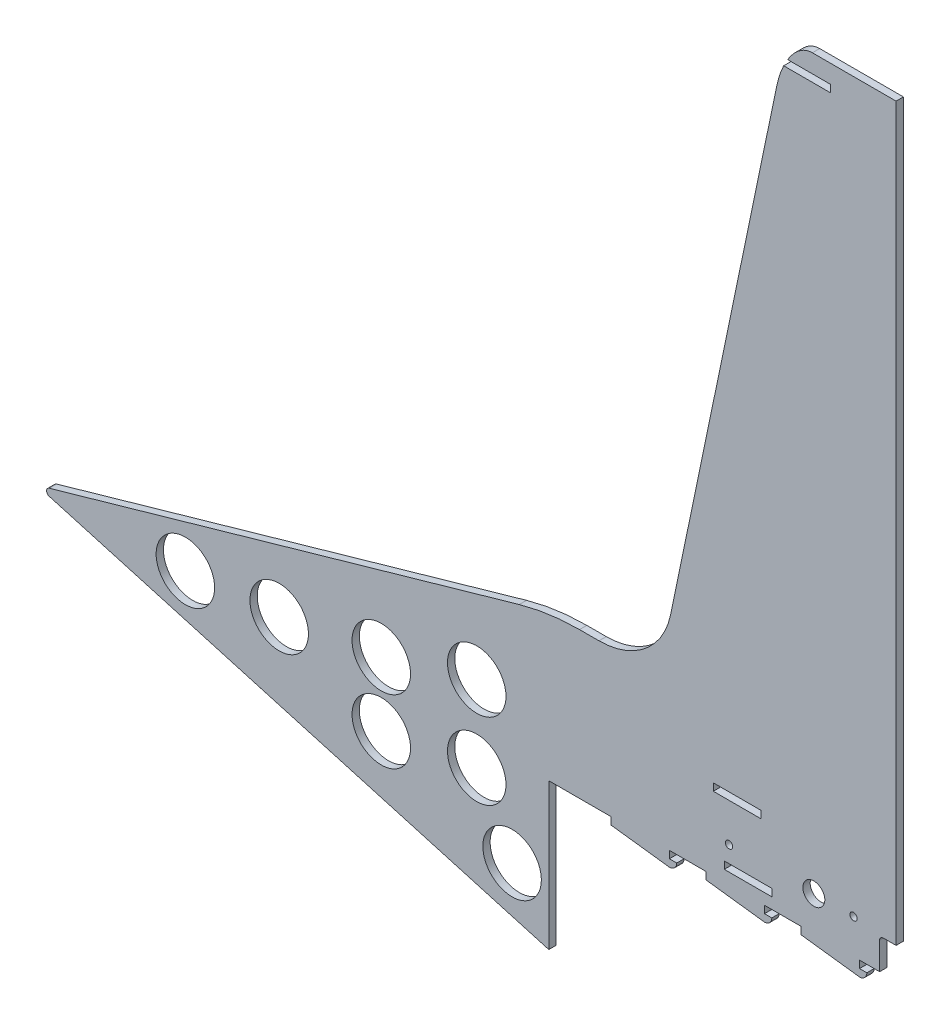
ISO-10303-21;
HEADER;
FILE_DESCRIPTION(('STEP AP214'),'2;1');
FILE_NAME('part.step','',(''),(''),'','','');
FILE_SCHEMA(('AUTOMOTIVE_DESIGN { 1 0 10303 214 1 1 1 1 }'));
ENDSEC;
DATA;
#1=APPLICATION_CONTEXT('core data for automotive mechanical design processes');
#2=APPLICATION_PROTOCOL_DEFINITION('international standard','automotive_design',2000,#1);
#3=PRODUCT_CONTEXT('',#1,'mechanical');
#4=PRODUCT('Part','Part','',(#3));
#5=PRODUCT_RELATED_PRODUCT_CATEGORY('part','',(#4));
#6=PRODUCT_DEFINITION_FORMATION('','',#4);
#7=PRODUCT_DEFINITION_CONTEXT('part definition',#1,'design');
#8=PRODUCT_DEFINITION('design','',#6,#7);
#9=PRODUCT_DEFINITION_SHAPE('','',#8);
#10=(LENGTH_UNIT() NAMED_UNIT(*) SI_UNIT(.MILLI.,.METRE.));
#11=(NAMED_UNIT(*) PLANE_ANGLE_UNIT() SI_UNIT($,.RADIAN.));
#12=(NAMED_UNIT(*) SI_UNIT($,.STERADIAN.) SOLID_ANGLE_UNIT());
#13=UNCERTAINTY_MEASURE_WITH_UNIT(LENGTH_MEASURE(1.E-05),#10,'distance_accuracy_value','');
#14=(GEOMETRIC_REPRESENTATION_CONTEXT(3) GLOBAL_UNCERTAINTY_ASSIGNED_CONTEXT((#13)) GLOBAL_UNIT_ASSIGNED_CONTEXT((#10,
#11,#12)) REPRESENTATION_CONTEXT('',''));
#15=CARTESIAN_POINT('',(0.,0.,0.));
#16=DIRECTION('',(0.,0.,1.));
#17=DIRECTION('',(1.,0.,0.));
#18=AXIS2_PLACEMENT_3D('',#15,#16,#17);
#19=CARTESIAN_POINT('',(-3.49999999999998,7.47997641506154,0.));
#20=DIRECTION('',(0.,0.,1.));
#21=DIRECTION('',(1.,0.,0.));
#22=AXIS2_PLACEMENT_3D('',#19,#20,#21);
#23=PLANE('',#22);
#24=DIRECTION('',(0.,1.,0.));
#25=VECTOR('',#24,1.);
#26=CARTESIAN_POINT('',(-50.,20.,0.));
#27=LINE('',#26,#25);
#28=CARTESIAN_POINT('',(-50.,20.,0.));
#29=VERTEX_POINT('',#28);
#30=CARTESIAN_POINT('',(-50.,22.,0.));
#31=VERTEX_POINT('',#30);
#32=EDGE_CURVE('E369',#29,#31,#27,.T.);
#33=ORIENTED_EDGE('',*,*,#32,.F.);
#34=DIRECTION('',(-1.,0.,0.));
#35=VECTOR('',#34,1.);
#36=CARTESIAN_POINT('',(-37.,20.,0.));
#37=LINE('',#36,#35);
#38=CARTESIAN_POINT('',(-37.,20.,0.));
#39=VERTEX_POINT('',#38);
#40=EDGE_CURVE('E367',#39,#29,#37,.T.);
#41=ORIENTED_EDGE('',*,*,#40,.F.);
#42=DIRECTION('',(0.,-1.,0.));
#43=VECTOR('',#42,1.);
#44=CARTESIAN_POINT('',(-37.,22.,0.));
#45=LINE('',#44,#43);
#46=CARTESIAN_POINT('',(-37.,22.,0.));
#47=VERTEX_POINT('',#46);
#48=EDGE_CURVE('E375',#47,#39,#45,.T.);
#49=ORIENTED_EDGE('',*,*,#48,.F.);
#50=DIRECTION('',(1.,0.,0.));
#51=VECTOR('',#50,1.);
#52=CARTESIAN_POINT('',(-50.,22.,0.));
#53=LINE('',#52,#51);
#54=EDGE_CURVE('E372',#31,#47,#53,.T.);
#55=ORIENTED_EDGE('',*,*,#54,.F.);
#56=EDGE_LOOP('',(#33,#41,#49,#55));
#57=FACE_BOUND('',#56,.T.);
#58=CARTESIAN_POINT('',(-11.6400000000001,9.49999999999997,0.));
#59=DIRECTION('',(0.,0.,-1.));
#60=DIRECTION('',(-1.,0.,0.));
#61=AXIS2_PLACEMENT_3D('',#58,#59,#60);
#62=CIRCLE('',#61,1.);
#63=CARTESIAN_POINT('',(-12.6400000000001,9.49999999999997,0.));
#64=VERTEX_POINT('',#63);
#65=EDGE_CURVE('E406',#64,#64,#62,.T.);
#66=ORIENTED_EDGE('',*,*,#65,.F.);
#67=EDGE_LOOP('',(#66));
#68=FACE_BOUND('',#67,.T.);
#69=CARTESIAN_POINT('',(-45.7000000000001,9.49999999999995,0.));
#70=DIRECTION('',(0.,0.,-1.));
#71=DIRECTION('',(-1.,0.,0.));
#72=AXIS2_PLACEMENT_3D('',#69,#70,#71);
#73=CIRCLE('',#72,0.999999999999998);
#74=CARTESIAN_POINT('',(-46.7000000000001,9.49999999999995,0.));
#75=VERTEX_POINT('',#74);
#76=EDGE_CURVE('E401',#75,#75,#73,.T.);
#77=ORIENTED_EDGE('',*,*,#76,.F.);
#78=EDGE_LOOP('',(#77));
#79=FACE_BOUND('',#78,.T.);
#80=DIRECTION('',(0.,1.,0.));
#81=VECTOR('',#80,1.);
#82=CARTESIAN_POINT('',(-18.,201.479976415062,0.));
#83=LINE('',#82,#81);
#84=CARTESIAN_POINT('',(-18.,201.479976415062,0.));
#85=VERTEX_POINT('',#84);
#86=CARTESIAN_POINT('',(-18.,203.479976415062,0.));
#87=VERTEX_POINT('',#86);
#88=EDGE_CURVE('E419',#85,#87,#83,.T.);
#89=ORIENTED_EDGE('',*,*,#88,.T.);
#90=DIRECTION('',(1.,0.,0.));
#91=VECTOR('',#90,1.);
#92=CARTESIAN_POINT('',(-3.5,203.479976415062,0.));
#93=LINE('',#92,#91);
#94=CARTESIAN_POINT('',(-29.675180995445,203.479976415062,0.));
#95=VERTEX_POINT('',#94);
#96=EDGE_CURVE('E432',#95,#87,#93,.T.);
#97=ORIENTED_EDGE('',*,*,#96,.F.);
#98=CARTESIAN_POINT('',(-22.9025972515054,208.479976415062,0.));
#99=CARTESIAN_POINT('',(-30.,208.479976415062,0.));
#100=CARTESIAN_POINT('',(-32.6935601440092,195.513949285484,0.));
#101=(BOUNDED_CURVE() B_SPLINE_CURVE(2,(#98,#99,#100),.UNSPECIFIED.,.F.,
.F.) B_SPLINE_CURVE_WITH_KNOTS((3,3),(0.,1.),
.UNSPECIFIED.) CURVE() GEOMETRIC_REPRESENTATION_ITEM() RATIONAL_B_SPLINE_CURVE((1.,
0.775692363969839,1.)) REPRESENTATION_ITEM(''));
#102=CARTESIAN_POINT('',(-22.9025972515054,208.479976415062,0.));
#103=VERTEX_POINT('',#102);
#104=EDGE_CURVE('E892',#95,#103,#101,.F.);
#105=ORIENTED_EDGE('',*,*,#104,.T.);
#106=DIRECTION('',(-1.,0.,0.));
#107=VECTOR('',#106,1.);
#108=CARTESIAN_POINT('',(-30.,208.479976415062,0.));
#109=LINE('',#108,#107);
#110=CARTESIAN_POINT('',(0.,208.479976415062,0.));
#111=VERTEX_POINT('',#110);
#112=EDGE_CURVE('E875',#111,#103,#109,.T.);
#113=ORIENTED_EDGE('',*,*,#112,.F.);
#114=DIRECTION('',(0.,1.,0.));
#115=VECTOR('',#114,1.);
#116=CARTESIAN_POINT('',(0.,208.479976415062,0.));
#117=LINE('',#116,#115);
#118=CARTESIAN_POINT('',(0.,8.47997641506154,0.));
#119=VERTEX_POINT('',#118);
#120=EDGE_CURVE('E873',#119,#111,#117,.T.);
#121=ORIENTED_EDGE('',*,*,#120,.F.);
#122=DIRECTION('',(1.,0.,0.));
#123=VECTOR('',#122,1.);
#124=CARTESIAN_POINT('',(0.,8.47997641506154,0.));
#125=LINE('',#124,#123);
#126=CARTESIAN_POINT('',(-3.49999999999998,8.47997641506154,0.));
#127=VERTEX_POINT('',#126);
#128=EDGE_CURVE('E871',#127,#119,#125,.T.);
#129=ORIENTED_EDGE('',*,*,#128,.F.);
#130=CARTESIAN_POINT('',(-3.49999999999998,7.47997641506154,0.));
#131=DIRECTION('',(0.,0.,-1.));
#132=DIRECTION('',(1.,0.,0.));
#133=AXIS2_PLACEMENT_3D('',#130,#131,#132);
#134=CIRCLE('',#133,1.);
#135=CARTESIAN_POINT('',(-4.49999999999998,7.47997641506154,0.));
#136=VERTEX_POINT('',#135);
#137=EDGE_CURVE('E869',#136,#127,#134,.T.);
#138=ORIENTED_EDGE('',*,*,#137,.F.);
#139=DIRECTION('',(0.,1.,0.));
#140=VECTOR('',#139,1.);
#141=CARTESIAN_POINT('',(-4.49999999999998,7.47997641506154,0.));
#142=LINE('',#141,#140);
#143=CARTESIAN_POINT('',(-4.49999999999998,0.,0.));
#144=VERTEX_POINT('',#143);
#145=EDGE_CURVE('E866',#144,#136,#142,.T.);
#146=ORIENTED_EDGE('',*,*,#145,.F.);
#147=DIRECTION('',(1.,0.,0.));
#148=VECTOR('',#147,1.);
#149=CARTESIAN_POINT('',(-65.0000000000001,0.,0.));
#150=LINE('',#149,#148);
#151=CARTESIAN_POINT('',(-9.99999999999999,0.,0.));
#152=VERTEX_POINT('',#151);
#153=EDGE_CURVE('E624',#152,#144,#150,.T.);
#154=ORIENTED_EDGE('',*,*,#153,.F.);
#155=DIRECTION('',(0.,1.,0.));
#156=VECTOR('',#155,1.);
#157=CARTESIAN_POINT('',(-9.99999999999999,-2.,0.));
#158=LINE('',#157,#156);
#159=CARTESIAN_POINT('',(-9.99999999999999,-2.,0.));
#160=VERTEX_POINT('',#159);
#161=EDGE_CURVE('E562',#160,#152,#158,.T.);
#162=ORIENTED_EDGE('',*,*,#161,.F.);
#163=DIRECTION('',(1.,0.,0.));
#164=VECTOR('',#163,1.);
#165=CARTESIAN_POINT('',(-9.99999999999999,-2.,0.));
#166=LINE('',#165,#164);
#167=CARTESIAN_POINT('',(-7.99999999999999,-2.,0.));
#168=VERTEX_POINT('',#167);
#169=EDGE_CURVE('E533',#160,#168,#166,.T.);
#170=ORIENTED_EDGE('',*,*,#169,.T.);
#171=CARTESIAN_POINT('',(-9.99999999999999,-2.,0.));
#172=DIRECTION('',(0.,0.,-1.));
#173=DIRECTION('',(1.,0.,0.));
#174=AXIS2_PLACEMENT_3D('',#171,#172,#173);
#175=CIRCLE('',#174,2.);
#176=CARTESIAN_POINT('',(-9.99999999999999,-4.,0.));
#177=VERTEX_POINT('',#176);
#178=EDGE_CURVE('E545',#168,#177,#175,.T.);
#179=ORIENTED_EDGE('',*,*,#178,.T.);
#180=DIRECTION('',(-0.992277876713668,0.124034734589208,0.));
#181=VECTOR('',#180,1.);
#182=CARTESIAN_POINT('',(-26.,-2.,0.));
#183=LINE('',#182,#181);
#184=CARTESIAN_POINT('',(-26.,-2.,0.));
#185=VERTEX_POINT('',#184);
#186=EDGE_CURVE('E537',#177,#185,#183,.T.);
#187=ORIENTED_EDGE('',*,*,#186,.T.);
#188=DIRECTION('',(0.,1.,0.));
#189=VECTOR('',#188,1.);
#190=CARTESIAN_POINT('',(-26.,-2.,0.));
#191=LINE('',#190,#189);
#192=CARTESIAN_POINT('',(-26.,0.,0.));
#193=VERTEX_POINT('',#192);
#194=EDGE_CURVE('E569',#185,#193,#191,.T.);
#195=ORIENTED_EDGE('',*,*,#194,.T.);
#196=CARTESIAN_POINT('',(-36.,0.,0.));
#197=VERTEX_POINT('',#196);
#198=EDGE_CURVE('E967',#197,#193,#150,.T.);
#199=ORIENTED_EDGE('',*,*,#198,.F.);
#200=DIRECTION('',(0.,1.,0.));
#201=VECTOR('',#200,1.);
#202=CARTESIAN_POINT('',(-36.,-2.00000000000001,0.));
#203=LINE('',#202,#201);
#204=CARTESIAN_POINT('',(-36.,-2.00000000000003,0.));
#205=VERTEX_POINT('',#204);
#206=EDGE_CURVE('E517',#205,#197,#203,.T.);
#207=ORIENTED_EDGE('',*,*,#206,.F.);
#208=DIRECTION('',(1.,0.,0.));
#209=VECTOR('',#208,1.);
#210=CARTESIAN_POINT('',(-36.,-2.00000000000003,0.));
#211=LINE('',#210,#209);
#212=CARTESIAN_POINT('',(-34.,-2.00000000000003,0.));
#213=VERTEX_POINT('',#212);
#214=EDGE_CURVE('E462',#205,#213,#211,.T.);
#215=ORIENTED_EDGE('',*,*,#214,.T.);
#216=CARTESIAN_POINT('',(-36.,-2.00000000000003,0.));
#217=DIRECTION('',(0.,0.,-1.));
#218=DIRECTION('',(1.,0.,0.));
#219=AXIS2_PLACEMENT_3D('',#216,#217,#218);
#220=CIRCLE('',#219,2.);
#221=CARTESIAN_POINT('',(-36.,-4.00000000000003,0.));
#222=VERTEX_POINT('',#221);
#223=EDGE_CURVE('E476',#213,#222,#220,.T.);
#224=ORIENTED_EDGE('',*,*,#223,.T.);
#225=DIRECTION('',(-0.992277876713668,0.124034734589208,0.));
#226=VECTOR('',#225,1.);
#227=CARTESIAN_POINT('',(-52.,-2.00000000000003,0.));
#228=LINE('',#227,#226);
#229=CARTESIAN_POINT('',(-52.,-2.00000000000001,0.));
#230=VERTEX_POINT('',#229);
#231=EDGE_CURVE('E468',#222,#230,#228,.T.);
#232=ORIENTED_EDGE('',*,*,#231,.T.);
#233=DIRECTION('',(0.,1.,0.));
#234=VECTOR('',#233,1.);
#235=CARTESIAN_POINT('',(-52.,-2.00000000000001,0.));
#236=LINE('',#235,#234);
#237=CARTESIAN_POINT('',(-52.,0.,0.));
#238=VERTEX_POINT('',#237);
#239=EDGE_CURVE('E524',#230,#238,#236,.T.);
#240=ORIENTED_EDGE('',*,*,#239,.T.);
#241=CARTESIAN_POINT('',(-62.,0.,0.));
#242=VERTEX_POINT('',#241);
#243=EDGE_CURVE('E867',#242,#238,#150,.T.);
#244=ORIENTED_EDGE('',*,*,#243,.F.);
#245=DIRECTION('',(0.,1.,0.));
#246=VECTOR('',#245,1.);
#247=CARTESIAN_POINT('',(-62.,-2.00000000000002,0.));
#248=LINE('',#247,#246);
#249=CARTESIAN_POINT('',(-62.,-2.00000000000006,0.));
#250=VERTEX_POINT('',#249);
#251=EDGE_CURVE('E493',#250,#242,#248,.T.);
#252=ORIENTED_EDGE('',*,*,#251,.F.);
#253=DIRECTION('',(1.,0.,0.));
#254=VECTOR('',#253,1.);
#255=CARTESIAN_POINT('',(-62.,-2.00000000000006,0.));
#256=LINE('',#255,#254);
#257=CARTESIAN_POINT('',(-60.,-2.00000000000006,0.));
#258=VERTEX_POINT('',#257);
#259=EDGE_CURVE('E441',#250,#258,#256,.T.);
#260=ORIENTED_EDGE('',*,*,#259,.T.);
#261=CARTESIAN_POINT('',(-62.,-2.00000000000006,0.));
#262=DIRECTION('',(0.,0.,-1.));
#263=DIRECTION('',(1.,0.,0.));
#264=AXIS2_PLACEMENT_3D('',#261,#262,#263);
#265=CIRCLE('',#264,2.);
#266=CARTESIAN_POINT('',(-62.,-4.00000000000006,0.));
#267=VERTEX_POINT('',#266);
#268=EDGE_CURVE('E455',#258,#267,#265,.T.);
#269=ORIENTED_EDGE('',*,*,#268,.T.);
#270=DIRECTION('',(-0.992277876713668,0.124034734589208,0.));
#271=VECTOR('',#270,1.);
#272=CARTESIAN_POINT('',(-78.,-2.00000000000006,0.));
#273=LINE('',#272,#271);
#274=CARTESIAN_POINT('',(-78.,-2.00000000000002,0.));
#275=VERTEX_POINT('',#274);
#276=EDGE_CURVE('E447',#267,#275,#273,.T.);
#277=ORIENTED_EDGE('',*,*,#276,.T.);
#278=DIRECTION('',(0.,1.,0.));
#279=VECTOR('',#278,1.);
#280=CARTESIAN_POINT('',(-78.,-2.00000000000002,0.));
#281=LINE('',#280,#279);
#282=CARTESIAN_POINT('',(-78.,0.,0.));
#283=VERTEX_POINT('',#282);
#284=EDGE_CURVE('E500',#275,#283,#281,.T.);
#285=ORIENTED_EDGE('',*,*,#284,.T.);
#286=CARTESIAN_POINT('',(-95.0000000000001,0.,0.));
#287=VERTEX_POINT('',#286);
#288=EDGE_CURVE('E864',#287,#283,#150,.T.);
#289=ORIENTED_EDGE('',*,*,#288,.F.);
#290=DIRECTION('',(0.,1.,0.));
#291=VECTOR('',#290,1.);
#292=CARTESIAN_POINT('',(-95.0000000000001,0.,0.));
#293=LINE('',#292,#291);
#294=CARTESIAN_POINT('',(-95.,-40.,0.));
#295=VERTEX_POINT('',#294);
#296=EDGE_CURVE('E970',#295,#287,#293,.T.);
#297=ORIENTED_EDGE('',*,*,#296,.F.);
#298=DIRECTION('',(0.961523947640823,-0.274721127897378,0.));
#299=VECTOR('',#298,1.);
#300=CARTESIAN_POINT('',(-95.,-40.,0.));
#301=LINE('',#300,#299);
#302=CARTESIAN_POINT('',(-231.634666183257,-0.961523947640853,0.));
#303=VERTEX_POINT('',#302);
#304=EDGE_CURVE('E936',#303,#295,#301,.T.);
#305=ORIENTED_EDGE('',*,*,#304,.F.);
#306=CARTESIAN_POINT('',(-231.35994505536,0.,0.));
#307=DIRECTION('',(0.,0.,1.));
#308=DIRECTION('',(1.,0.,0.));
#309=AXIS2_PLACEMENT_3D('',#306,#307,#308);
#310=CIRCLE('',#309,1.);
#311=CARTESIAN_POINT('',(-231.634666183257,0.961523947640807,0.));
#312=VERTEX_POINT('',#311);
#313=EDGE_CURVE('E782',#303,#312,#310,.F.);
#314=ORIENTED_EDGE('',*,*,#313,.T.);
#315=DIRECTION('',(-0.961523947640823,-0.274721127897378,0.));
#316=VECTOR('',#315,1.);
#317=CARTESIAN_POINT('',(-235.,0.,0.));
#318=LINE('',#317,#316);
#319=CARTESIAN_POINT('',(-103.079970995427,37.6914368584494,0.));
#320=VERTEX_POINT('',#319);
#321=EDGE_CURVE('E841',#320,#312,#318,.T.);
#322=ORIENTED_EDGE('',*,*,#321,.F.);
#323=CARTESIAN_POINT('',(-86.5967033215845,-20.,0.));
#324=DIRECTION('',(0.,0.,1.));
#325=DIRECTION('',(1.,0.,0.));
#326=AXIS2_PLACEMENT_3D('',#323,#324,#325);
#327=CIRCLE('',#326,60.);
#328=CARTESIAN_POINT('',(-86.5967033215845,40.,0.));
#329=VERTEX_POINT('',#328);
#330=EDGE_CURVE('E773',#320,#329,#327,.F.);
#331=ORIENTED_EDGE('',*,*,#330,.T.);
#332=DIRECTION('',(-1.,0.,0.));
#333=VECTOR('',#332,1.);
#334=CARTESIAN_POINT('',(-95.,40.,0.));
#335=LINE('',#334,#333);
#336=CARTESIAN_POINT('',(-81.2722036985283,40.,0.));
#337=VERTEX_POINT('',#336);
#338=EDGE_CURVE('E835',#337,#329,#335,.T.);
#339=ORIENTED_EDGE('',*,*,#338,.F.);
#340=CARTESIAN_POINT('',(-81.2722036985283,60.,0.));
#341=DIRECTION('',(0.,0.,1.));
#342=DIRECTION('',(1.,0.,0.));
#343=AXIS2_PLACEMENT_3D('',#340,#341,#342);
#344=CIRCLE('',#343,20.);
#345=CARTESIAN_POINT('',(-61.6902779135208,55.9320542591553,0.));
#346=VERTEX_POINT('',#345);
#347=EDGE_CURVE('E766',#337,#346,#344,.T.);
#348=ORIENTED_EDGE('',*,*,#347,.T.);
#349=DIRECTION('',(-0.203397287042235,-0.979096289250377,0.));
#350=VECTOR('',#349,1.);
#351=CARTESIAN_POINT('',(-65.0000000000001,40.,0.));
#352=LINE('',#351,#350);
#353=CARTESIAN_POINT('',(-32.6935601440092,195.513949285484,0.));
#354=VERTEX_POINT('',#353);
#355=EDGE_CURVE('E842',#354,#346,#352,.T.);
#356=ORIENTED_EDGE('',*,*,#355,.F.);
#357=CARTESIAN_POINT('',(-22.9025972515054,208.479976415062,0.));
#358=CARTESIAN_POINT('',(-30.,208.479976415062,0.));
#359=CARTESIAN_POINT('',(-32.6935601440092,195.513949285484,0.));
#360=(BOUNDED_CURVE() B_SPLINE_CURVE(2,(#357,#358,#359),.UNSPECIFIED.,.F.,
.F.) B_SPLINE_CURVE_WITH_KNOTS((3,3),(0.,1.),
.UNSPECIFIED.) CURVE() GEOMETRIC_REPRESENTATION_ITEM() RATIONAL_B_SPLINE_CURVE((1.,
0.775692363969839,1.)) REPRESENTATION_ITEM(''));
#361=CARTESIAN_POINT('',(-30.7454489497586,201.479976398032,0.));
#362=VERTEX_POINT('',#361);
#363=EDGE_CURVE('E886',#354,#362,#360,.F.);
#364=ORIENTED_EDGE('',*,*,#363,.T.);
#365=DIRECTION('',(1.,0.,0.));
#366=VECTOR('',#365,1.);
#367=CARTESIAN_POINT('',(-3.5,201.479976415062,0.));
#368=LINE('',#367,#366);
#369=EDGE_CURVE('E425',#362,#85,#368,.T.);
#370=ORIENTED_EDGE('',*,*,#369,.T.);
#371=EDGE_LOOP('',(#89,#97,#105,#113,#121,#129,#138,#146,#154,#162,#170,#179,#187,#195,#199,
#207,#215,#224,#232,#240,#244,#252,#260,#269,#277,#285,#289,#297,#305,#314,#322,#331,#339,#348,
#356,#364,#370));
#372=FACE_BOUND('',#371,.T.);
#373=CARTESIAN_POINT('',(-114.707156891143,-6.79626076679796,0.));
#374=DIRECTION('',(0.,0.,1.));
#375=DIRECTION('',(1.,0.,0.));
#376=AXIS2_PLACEMENT_3D('',#373,#374,#375);
#377=CIRCLE('',#376,8.00000000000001);
#378=CARTESIAN_POINT('',(-106.707156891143,-6.79626076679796,0.));
#379=VERTEX_POINT('',#378);
#380=EDGE_CURVE('E618',#379,#379,#377,.T.);
#381=ORIENTED_EDGE('',*,*,#380,.T.);
#382=EDGE_LOOP('',(#381));
#383=FACE_BOUND('',#382,.T.);
#384=CARTESIAN_POINT('',(-114.707156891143,14.1089410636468,0.));
#385=DIRECTION('',(0.,0.,1.));
#386=DIRECTION('',(1.,0.,0.));
#387=AXIS2_PLACEMENT_3D('',#384,#385,#386);
#388=CIRCLE('',#387,8.00000000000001);
#389=CARTESIAN_POINT('',(-106.707156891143,14.1089410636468,0.));
#390=VERTEX_POINT('',#389);
#391=EDGE_CURVE('E612',#390,#390,#388,.T.);
#392=ORIENTED_EDGE('',*,*,#391,.T.);
#393=EDGE_LOOP('',(#392));
#394=FACE_BOUND('',#393,.T.);
#395=CARTESIAN_POINT('',(-140.816859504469,6.35799672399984,0.));
#396=DIRECTION('',(0.,0.,1.));
#397=DIRECTION('',(1.,0.,0.));
#398=AXIS2_PLACEMENT_3D('',#395,#396,#397);
#399=CIRCLE('',#398,8.00000000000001);
#400=CARTESIAN_POINT('',(-132.816859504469,6.35799672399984,0.));
#401=VERTEX_POINT('',#400);
#402=EDGE_CURVE('E606',#401,#401,#399,.T.);
#403=ORIENTED_EDGE('',*,*,#402,.T.);
#404=EDGE_LOOP('',(#403));
#405=FACE_BOUND('',#404,.T.);
#406=CARTESIAN_POINT('',(-168.739261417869,1.88376865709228,0.));
#407=DIRECTION('',(0.,0.,1.));
#408=DIRECTION('',(1.,0.,0.));
#409=AXIS2_PLACEMENT_3D('',#406,#407,#408);
#410=CIRCLE('',#409,8.00000000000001);
#411=CARTESIAN_POINT('',(-160.739261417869,1.88376865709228,0.));
#412=VERTEX_POINT('',#411);
#413=EDGE_CURVE('E600',#412,#412,#410,.T.);
#414=ORIENTED_EDGE('',*,*,#413,.T.);
#415=EDGE_LOOP('',(#414));
#416=FACE_BOUND('',#415,.T.);
#417=CARTESIAN_POINT('',(-140.816859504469,-11.188977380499,0.));
#418=DIRECTION('',(0.,0.,1.));
#419=DIRECTION('',(1.,0.,0.));
#420=AXIS2_PLACEMENT_3D('',#417,#418,#419);
#421=CIRCLE('',#420,8.00000000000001);
#422=CARTESIAN_POINT('',(-132.816859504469,-11.188977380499,0.));
#423=VERTEX_POINT('',#422);
#424=EDGE_CURVE('E594',#423,#423,#421,.T.);
#425=ORIENTED_EDGE('',*,*,#424,.T.);
#426=EDGE_LOOP('',(#425));
#427=FACE_BOUND('',#426,.T.);
#428=CARTESIAN_POINT('',(-194.398099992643,0.,0.));
#429=DIRECTION('',(0.,0.,1.));
#430=DIRECTION('',(1.,0.,0.));
#431=AXIS2_PLACEMENT_3D('',#428,#429,#430);
#432=CIRCLE('',#431,8.00000000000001);
#433=CARTESIAN_POINT('',(-186.398099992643,0.,0.));
#434=VERTEX_POINT('',#433);
#435=EDGE_CURVE('E588',#434,#434,#432,.T.);
#436=ORIENTED_EDGE('',*,*,#435,.T.);
#437=EDGE_LOOP('',(#436));
#438=FACE_BOUND('',#437,.T.);
#439=CARTESIAN_POINT('',(-105.032178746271,-24.5327738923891,0.));
#440=DIRECTION('',(0.,0.,1.));
#441=DIRECTION('',(1.,0.,0.));
#442=AXIS2_PLACEMENT_3D('',#439,#440,#441);
#443=CIRCLE('',#442,8.00000000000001);
#444=CARTESIAN_POINT('',(-97.0321787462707,-24.5327738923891,0.));
#445=VERTEX_POINT('',#444);
#446=EDGE_CURVE('E584',#445,#445,#443,.T.);
#447=ORIENTED_EDGE('',*,*,#446,.T.);
#448=EDGE_LOOP('',(#447));
#449=FACE_BOUND('',#448,.T.);
#450=CARTESIAN_POINT('',(-22.5000000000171,9.50000000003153,0.));
#451=DIRECTION('',(0.,0.,-1.));
#452=DIRECTION('',(0.,1.,0.));
#453=AXIS2_PLACEMENT_3D('',#450,#451,#452);
#454=CIRCLE('',#453,3.);
#455=CARTESIAN_POINT('',(-22.5000000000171,12.5000000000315,0.));
#456=VERTEX_POINT('',#455);
#457=EDGE_CURVE('E578',#456,#456,#454,.T.);
#458=ORIENTED_EDGE('',*,*,#457,.F.);
#459=EDGE_LOOP('',(#458));
#460=FACE_BOUND('',#459,.T.);
#461=DIRECTION('',(0.,-1.,0.));
#462=VECTOR('',#461,1.);
#463=CARTESIAN_POINT('',(-34.,5.00000000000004,0.));
#464=LINE('',#463,#462);
#465=CARTESIAN_POINT('',(-34.,5.00000000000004,0.));
#466=VERTEX_POINT('',#465);
#467=CARTESIAN_POINT('',(-34.,3.00000000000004,0.));
#468=VERTEX_POINT('',#467);
#469=EDGE_CURVE('E338',#466,#468,#464,.T.);
#470=ORIENTED_EDGE('',*,*,#469,.F.);
#471=DIRECTION('',(1.,0.,0.));
#472=VECTOR('',#471,1.);
#473=CARTESIAN_POINT('',(-47.,5.00000000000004,0.));
#474=LINE('',#473,#472);
#475=CARTESIAN_POINT('',(-47.,5.00000000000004,0.));
#476=VERTEX_POINT('',#475);
#477=EDGE_CURVE('E330',#476,#466,#474,.T.);
#478=ORIENTED_EDGE('',*,*,#477,.F.);
#479=DIRECTION('',(0.,1.,0.));
#480=VECTOR('',#479,1.);
#481=CARTESIAN_POINT('',(-47.,3.00000000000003,0.));
#482=LINE('',#481,#480);
#483=CARTESIAN_POINT('',(-47.,3.00000000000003,0.));
#484=VERTEX_POINT('',#483);
#485=EDGE_CURVE('E354',#484,#476,#482,.T.);
#486=ORIENTED_EDGE('',*,*,#485,.F.);
#487=DIRECTION('',(-1.,0.,0.));
#488=VECTOR('',#487,1.);
#489=CARTESIAN_POINT('',(-34.,3.00000000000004,0.));
#490=LINE('',#489,#488);
#491=EDGE_CURVE('E352',#468,#484,#490,.T.);
#492=ORIENTED_EDGE('',*,*,#491,.F.);
#493=EDGE_LOOP('',(#470,#478,#486,#492));
#494=FACE_BOUND('',#493,.T.);
#495=ADVANCED_FACE('F42',(#57,#68,#79,#372,#383,#394,#405,#416,#427,#438,#449,#460,#494),#23,.F.);
#496=CARTESIAN_POINT('',(-32.6935601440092,195.513949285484,2.1));
#497=CARTESIAN_POINT('',(-32.6935601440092,195.513949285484,1.36666666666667));
#498=CARTESIAN_POINT('',(-32.6935601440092,195.513949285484,0.633333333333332));
#499=CARTESIAN_POINT('',(-32.6935601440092,195.513949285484,-0.0999999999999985));
#500=CARTESIAN_POINT('',(-30.,208.479976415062,2.1));
#501=CARTESIAN_POINT('',(-30.,208.479976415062,1.36666666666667));
#502=CARTESIAN_POINT('',(-30.,208.479976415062,0.633333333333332));
#503=CARTESIAN_POINT('',(-30.,208.479976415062,-0.0999999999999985));
#504=CARTESIAN_POINT('',(-22.9025972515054,208.479976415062,2.1));
#505=CARTESIAN_POINT('',(-22.9025972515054,208.479976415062,1.36666666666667));
#506=CARTESIAN_POINT('',(-22.9025972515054,208.479976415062,0.633333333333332));
#507=CARTESIAN_POINT('',(-22.9025972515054,208.479976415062,-0.0999999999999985));
#508=(BOUNDED_SURFACE() B_SPLINE_SURFACE(2,3,((#496,#497,#498,#499),(#500,#501,#502,#503),(#504,
#505,#506,#507)),.UNSPECIFIED.,.F.,.F.,.F.) B_SPLINE_SURFACE_WITH_KNOTS((3,3),(4,4),(0.,1.),
(-0.0001,0.0021),.UNSPECIFIED.) GEOMETRIC_REPRESENTATION_ITEM() RATIONAL_B_SPLINE_SURFACE(((1.,
1.,1.,1.),(0.775692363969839,0.775692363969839,0.775692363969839,0.775692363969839),(1.,1.,1.,1.))) REPRESENTATION_ITEM('') SURFACE());
#509=DIRECTION('',(0.,0.,-1.));
#510=VECTOR('',#509,1.);
#511=CARTESIAN_POINT('',(-29.675180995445,203.479976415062,1.));
#512=LINE('',#511,#510);
#513=CARTESIAN_POINT('',(-29.675180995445,203.479976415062,2.));
#514=VERTEX_POINT('',#513);
#515=EDGE_CURVE('E13',#95,#514,#512,.F.);
#516=CARTESIAN_POINT('',(-32.6935601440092,195.513949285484,2.));
#517=CARTESIAN_POINT('',(-30.,208.479976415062,2.));
#518=CARTESIAN_POINT('',(-22.9025972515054,208.479976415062,2.));
#519=(BOUNDED_CURVE() B_SPLINE_CURVE(2,(#516,#517,#518),.UNSPECIFIED.,.F.,
.F.) B_SPLINE_CURVE_WITH_KNOTS((3,3),(0.,1.),
.UNSPECIFIED.) CURVE() GEOMETRIC_REPRESENTATION_ITEM() RATIONAL_B_SPLINE_CURVE((1.,
0.775692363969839,1.)) REPRESENTATION_ITEM(''));
#520=CARTESIAN_POINT('',(-22.9025972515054,208.479976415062,2.));
#521=VERTEX_POINT('',#520);
#522=EDGE_CURVE('E764',#521,#514,#519,.F.);
#523=CARTESIAN_POINT('',(-22.9025972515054,208.479976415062,2.1));
#524=CARTESIAN_POINT('',(-22.9025972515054,208.479976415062,1.36666666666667));
#525=CARTESIAN_POINT('',(-22.9025972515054,208.479976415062,0.633333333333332));
#526=CARTESIAN_POINT('',(-22.9025972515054,208.479976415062,-0.0999999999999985));
#527=(BOUNDED_CURVE() B_SPLINE_CURVE(3,(#523,#524,#525,#526),.UNSPECIFIED.,.F.,
.F.) B_SPLINE_CURVE_WITH_KNOTS((4,4),(-0.0001,0.0021),
.UNSPECIFIED.) CURVE() GEOMETRIC_REPRESENTATION_ITEM() RATIONAL_B_SPLINE_CURVE((1.,1.,1.,1.)) REPRESENTATION_ITEM(''));
#528=EDGE_CURVE('E659',#103,#521,#527,.F.);
#529=ORIENTED_EDGE('',*,*,#104,.F.);
#530=ORIENTED_EDGE('',*,*,#515,.T.);
#531=ORIENTED_EDGE('',*,*,#522,.F.);
#532=ORIENTED_EDGE('',*,*,#528,.F.);
#533=EDGE_LOOP('',(#529,#530,#531,#532));
#534=FACE_BOUND('',#533,.T.);
#535=ADVANCED_FACE('F713',(#534),#508,.T.);
#536=CARTESIAN_POINT('',(-65.0000000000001,0.,2.));
#537=DIRECTION('',(0.,1.,0.));
#538=DIRECTION('',(0.,0.,1.));
#539=AXIS2_PLACEMENT_3D('',#536,#537,#538);
#540=PLANE('',#539);
#541=DIRECTION('',(0.,0.,1.));
#542=VECTOR('',#541,1.);
#543=CARTESIAN_POINT('',(-62.,0.,0.));
#544=LINE('',#543,#542);
#545=CARTESIAN_POINT('',(-62.,0.,2.));
#546=VERTEX_POINT('',#545);
#547=EDGE_CURVE('E483',#242,#546,#544,.T.);
#548=ORIENTED_EDGE('',*,*,#547,.F.);
#549=ORIENTED_EDGE('',*,*,#243,.T.);
#550=DIRECTION('',(0.,0.,-1.));
#551=VECTOR('',#550,1.);
#552=CARTESIAN_POINT('',(-52.,0.,0.));
#553=LINE('',#552,#551);
#554=CARTESIAN_POINT('',(-52.,0.,2.));
#555=VERTEX_POINT('',#554);
#556=EDGE_CURVE('E514',#555,#238,#553,.T.);
#557=ORIENTED_EDGE('',*,*,#556,.F.);
#558=DIRECTION('',(1.,0.,0.));
#559=VECTOR('',#558,1.);
#560=CARTESIAN_POINT('',(-65.0000000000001,0.,2.));
#561=LINE('',#560,#559);
#562=EDGE_CURVE('E631',#546,#555,#561,.T.);
#563=ORIENTED_EDGE('',*,*,#562,.F.);
#564=EDGE_LOOP('',(#548,#549,#557,#563));
#565=FACE_BOUND('',#564,.T.);
#566=ADVANCED_FACE('F700',(#565),#540,.F.);
#567=DIRECTION('',(0.,0.,-1.));
#568=VECTOR('',#567,1.);
#569=CARTESIAN_POINT('',(-78.,0.,0.));
#570=LINE('',#569,#568);
#571=CARTESIAN_POINT('',(-78.,0.,2.));
#572=VERTEX_POINT('',#571);
#573=EDGE_CURVE('E490',#572,#283,#570,.T.);
#574=ORIENTED_EDGE('',*,*,#573,.F.);
#575=CARTESIAN_POINT('',(-95.0000000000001,0.,2.));
#576=VERTEX_POINT('',#575);
#577=EDGE_CURVE('E627',#576,#572,#561,.T.);
#578=ORIENTED_EDGE('',*,*,#577,.F.);
#579=DIRECTION('',(0.,0.,-1.));
#580=VECTOR('',#579,1.);
#581=CARTESIAN_POINT('',(-95.0000000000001,0.,2.));
#582=LINE('',#581,#580);
#583=EDGE_CURVE('E863',#576,#287,#582,.T.);
#584=ORIENTED_EDGE('',*,*,#583,.T.);
#585=ORIENTED_EDGE('',*,*,#288,.T.);
#586=EDGE_LOOP('',(#574,#578,#584,#585));
#587=FACE_BOUND('',#586,.T.);
#588=ADVANCED_FACE('F1456',(#587),#540,.F.);
#589=DIRECTION('',(0.,0.,1.));
#590=VECTOR('',#589,1.);
#591=CARTESIAN_POINT('',(-36.,0.,0.));
#592=LINE('',#591,#590);
#593=CARTESIAN_POINT('',(-36.,0.,2.));
#594=VERTEX_POINT('',#593);
#595=EDGE_CURVE('E509',#197,#594,#592,.T.);
#596=ORIENTED_EDGE('',*,*,#595,.F.);
#597=ORIENTED_EDGE('',*,*,#198,.T.);
#598=DIRECTION('',(0.,0.,-1.));
#599=VECTOR('',#598,1.);
#600=CARTESIAN_POINT('',(-26.,0.,0.));
#601=LINE('',#600,#599);
#602=CARTESIAN_POINT('',(-26.,0.,2.));
#603=VERTEX_POINT('',#602);
#604=EDGE_CURVE('E559',#603,#193,#601,.T.);
#605=ORIENTED_EDGE('',*,*,#604,.F.);
#606=EDGE_CURVE('E968',#594,#603,#561,.T.);
#607=ORIENTED_EDGE('',*,*,#606,.F.);
#608=EDGE_LOOP('',(#596,#597,#605,#607));
#609=FACE_BOUND('',#608,.T.);
#610=ADVANCED_FACE('F698',(#609),#540,.F.);
#611=DIRECTION('',(0.,0.,1.));
#612=VECTOR('',#611,1.);
#613=CARTESIAN_POINT('',(-9.99999999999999,0.,0.));
#614=LINE('',#613,#612);
#615=CARTESIAN_POINT('',(-10.,0.,2.));
#616=VERTEX_POINT('',#615);
#617=EDGE_CURVE('E552',#152,#616,#614,.T.);
#618=ORIENTED_EDGE('',*,*,#617,.F.);
#619=ORIENTED_EDGE('',*,*,#153,.T.);
#620=DIRECTION('',(0.,0.,-1.));
#621=VECTOR('',#620,1.);
#622=CARTESIAN_POINT('',(-4.49999999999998,0.,2.));
#623=LINE('',#622,#621);
#624=CARTESIAN_POINT('',(-4.49999999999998,0.,2.));
#625=VERTEX_POINT('',#624);
#626=EDGE_CURVE('E897',#625,#144,#623,.T.);
#627=ORIENTED_EDGE('',*,*,#626,.F.);
#628=EDGE_CURVE('E632',#616,#625,#561,.T.);
#629=ORIENTED_EDGE('',*,*,#628,.F.);
#630=EDGE_LOOP('',(#618,#619,#627,#629));
#631=FACE_BOUND('',#630,.T.);
#632=ADVANCED_FACE('F696',(#631),#540,.F.);
#633=CARTESIAN_POINT('',(-3.49999999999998,7.47997641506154,2.));
#634=DIRECTION('',(0.,0.,1.));
#635=DIRECTION('',(1.,0.,0.));
#636=AXIS2_PLACEMENT_3D('',#633,#634,#635);
#637=PLANE('',#636);
#638=DIRECTION('',(0.,1.,0.));
#639=VECTOR('',#638,1.);
#640=CARTESIAN_POINT('',(-47.,3.00000000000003,2.00000000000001));
#641=LINE('',#640,#639);
#642=CARTESIAN_POINT('',(-47.,3.00000000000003,1.99999999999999));
#643=VERTEX_POINT('',#642);
#644=CARTESIAN_POINT('',(-47.,5.00000000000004,2.));
#645=VERTEX_POINT('',#644);
#646=EDGE_CURVE('E339',#643,#645,#641,.T.);
#647=ORIENTED_EDGE('',*,*,#646,.T.);
#648=DIRECTION('',(1.,0.,0.));
#649=VECTOR('',#648,1.);
#650=CARTESIAN_POINT('',(-3.49999999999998,5.00000000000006,2.));
#651=LINE('',#650,#649);
#652=CARTESIAN_POINT('',(-34.,5.00000000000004,1.99999999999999));
#653=VERTEX_POINT('',#652);
#654=EDGE_CURVE('E399',#645,#653,#651,.T.);
#655=ORIENTED_EDGE('',*,*,#654,.T.);
#656=DIRECTION('',(0.,-1.,0.));
#657=VECTOR('',#656,1.);
#658=CARTESIAN_POINT('',(-34.,5.00000000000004,2.00000000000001));
#659=LINE('',#658,#657);
#660=CARTESIAN_POINT('',(-34.,3.00000000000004,2.00000000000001));
#661=VERTEX_POINT('',#660);
#662=EDGE_CURVE('E346',#653,#661,#659,.T.);
#663=ORIENTED_EDGE('',*,*,#662,.T.);
#664=DIRECTION('',(-1.,0.,0.));
#665=VECTOR('',#664,1.);
#666=CARTESIAN_POINT('',(-3.49999999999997,3.00000000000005,2.));
#667=LINE('',#666,#665);
#668=EDGE_CURVE('E396',#661,#643,#667,.T.);
#669=ORIENTED_EDGE('',*,*,#668,.T.);
#670=EDGE_LOOP('',(#647,#655,#663,#669));
#671=FACE_BOUND('',#670,.T.);
#672=DIRECTION('',(0.,-1.,0.));
#673=VECTOR('',#672,1.);
#674=CARTESIAN_POINT('',(-37.,22.,2.00000000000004));
#675=LINE('',#674,#673);
#676=CARTESIAN_POINT('',(-37.,22.,2.00000000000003));
#677=VERTEX_POINT('',#676);
#678=CARTESIAN_POINT('',(-37.,20.,2.));
#679=VERTEX_POINT('',#678);
#680=EDGE_CURVE('E370',#677,#679,#675,.T.);
#681=ORIENTED_EDGE('',*,*,#680,.T.);
#682=DIRECTION('',(-1.,0.,0.));
#683=VECTOR('',#682,1.);
#684=CARTESIAN_POINT('',(-3.49999999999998,20.,2.));
#685=LINE('',#684,#683);
#686=CARTESIAN_POINT('',(-50.,20.,2.00000000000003));
#687=VERTEX_POINT('',#686);
#688=EDGE_CURVE('E393',#679,#687,#685,.T.);
#689=ORIENTED_EDGE('',*,*,#688,.T.);
#690=DIRECTION('',(0.,1.,0.));
#691=VECTOR('',#690,1.);
#692=CARTESIAN_POINT('',(-50.,20.,2.00000000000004));
#693=LINE('',#692,#691);
#694=CARTESIAN_POINT('',(-50.,22.,2.00000000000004));
#695=VERTEX_POINT('',#694);
#696=EDGE_CURVE('E377',#687,#695,#693,.T.);
#697=ORIENTED_EDGE('',*,*,#696,.T.);
#698=DIRECTION('',(1.,0.,0.));
#699=VECTOR('',#698,1.);
#700=CARTESIAN_POINT('',(-3.49999999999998,22.,2.));
#701=LINE('',#700,#699);
#702=EDGE_CURVE('E347',#695,#677,#701,.T.);
#703=ORIENTED_EDGE('',*,*,#702,.T.);
#704=EDGE_LOOP('',(#681,#689,#697,#703));
#705=FACE_BOUND('',#704,.T.);
#706=CARTESIAN_POINT('',(-11.6400000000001,9.49999999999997,2.));
#707=DIRECTION('',(0.,0.,-1.));
#708=DIRECTION('',(-1.,0.,0.));
#709=AXIS2_PLACEMENT_3D('',#706,#707,#708);
#710=CIRCLE('',#709,1.);
#711=CARTESIAN_POINT('',(-12.6400000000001,9.49999999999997,2.));
#712=VERTEX_POINT('',#711);
#713=EDGE_CURVE('E402',#712,#712,#710,.T.);
#714=ORIENTED_EDGE('',*,*,#713,.T.);
#715=EDGE_LOOP('',(#714));
#716=FACE_BOUND('',#715,.T.);
#717=CARTESIAN_POINT('',(-45.7000000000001,9.49999999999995,2.));
#718=DIRECTION('',(0.,0.,-1.));
#719=DIRECTION('',(-1.,0.,0.));
#720=AXIS2_PLACEMENT_3D('',#717,#718,#719);
#721=CIRCLE('',#720,0.999999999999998);
#722=CARTESIAN_POINT('',(-46.7000000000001,9.49999999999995,2.));
#723=VERTEX_POINT('',#722);
#724=EDGE_CURVE('E409',#723,#723,#721,.T.);
#725=ORIENTED_EDGE('',*,*,#724,.T.);
#726=EDGE_LOOP('',(#725));
#727=FACE_BOUND('',#726,.T.);
#728=DIRECTION('',(0.,1.,0.));
#729=VECTOR('',#728,1.);
#730=CARTESIAN_POINT('',(0.,208.479976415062,2.));
#731=LINE('',#730,#729);
#732=CARTESIAN_POINT('',(0.,8.47997641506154,2.));
#733=VERTEX_POINT('',#732);
#734=CARTESIAN_POINT('',(0.,208.479976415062,2.));
#735=VERTEX_POINT('',#734);
#736=EDGE_CURVE('E638',#733,#735,#731,.T.);
#737=ORIENTED_EDGE('',*,*,#736,.T.);
#738=DIRECTION('',(-1.,0.,0.));
#739=VECTOR('',#738,1.);
#740=CARTESIAN_POINT('',(-30.,208.479976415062,2.));
#741=LINE('',#740,#739);
#742=EDGE_CURVE('E640',#735,#521,#741,.T.);
#743=ORIENTED_EDGE('',*,*,#742,.T.);
#744=ORIENTED_EDGE('',*,*,#522,.T.);
#745=DIRECTION('',(1.,0.,0.));
#746=VECTOR('',#745,1.);
#747=CARTESIAN_POINT('',(-3.5,203.479976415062,2.));
#748=LINE('',#747,#746);
#749=CARTESIAN_POINT('',(-18.,203.479976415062,1.99999999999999));
#750=VERTEX_POINT('',#749);
#751=EDGE_CURVE('E436',#514,#750,#748,.T.);
#752=ORIENTED_EDGE('',*,*,#751,.T.);
#753=DIRECTION('',(0.,-1.,0.));
#754=VECTOR('',#753,1.);
#755=CARTESIAN_POINT('',(-18.,201.479976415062,1.99999999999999));
#756=LINE('',#755,#754);
#757=CARTESIAN_POINT('',(-18.,201.479976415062,1.99999999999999));
#758=VERTEX_POINT('',#757);
#759=EDGE_CURVE('E405',#750,#758,#756,.T.);
#760=ORIENTED_EDGE('',*,*,#759,.T.);
#761=DIRECTION('',(1.,0.,0.));
#762=VECTOR('',#761,1.);
#763=CARTESIAN_POINT('',(-3.5,201.479976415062,2.));
#764=LINE('',#763,#762);
#765=CARTESIAN_POINT('',(-30.7454485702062,201.479976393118,2.));
#766=VERTEX_POINT('',#765);
#767=EDGE_CURVE('E428',#766,#758,#764,.T.);
#768=ORIENTED_EDGE('',*,*,#767,.F.);
#769=CARTESIAN_POINT('',(-32.6935601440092,195.513949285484,2.));
#770=CARTESIAN_POINT('',(-30.,208.479976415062,2.));
#771=CARTESIAN_POINT('',(-22.9025972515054,208.479976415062,2.));
#772=(BOUNDED_CURVE() B_SPLINE_CURVE(2,(#769,#770,#771),.UNSPECIFIED.,.F.,
.F.) B_SPLINE_CURVE_WITH_KNOTS((3,3),(0.,1.),
.UNSPECIFIED.) CURVE() GEOMETRIC_REPRESENTATION_ITEM() RATIONAL_B_SPLINE_CURVE((1.,
0.775692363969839,1.)) REPRESENTATION_ITEM(''));
#773=CARTESIAN_POINT('',(-32.6935601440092,195.513949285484,2.));
#774=VERTEX_POINT('',#773);
#775=EDGE_CURVE('E793',#766,#774,#772,.F.);
#776=ORIENTED_EDGE('',*,*,#775,.T.);
#777=DIRECTION('',(-0.203397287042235,-0.979096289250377,0.));
#778=VECTOR('',#777,1.);
#779=CARTESIAN_POINT('',(-65.0000000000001,40.,2.));
#780=LINE('',#779,#778);
#781=CARTESIAN_POINT('',(-61.6902779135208,55.9320542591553,2.));
#782=VERTEX_POINT('',#781);
#783=EDGE_CURVE('E649',#774,#782,#780,.T.);
#784=ORIENTED_EDGE('',*,*,#783,.T.);
#785=CARTESIAN_POINT('',(-81.2722036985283,60.,2.));
#786=DIRECTION('',(0.,0.,1.));
#787=DIRECTION('',(1.,0.,0.));
#788=AXIS2_PLACEMENT_3D('',#785,#786,#787);
#789=CIRCLE('',#788,20.);
#790=CARTESIAN_POINT('',(-81.2722036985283,40.,2.));
#791=VERTEX_POINT('',#790);
#792=EDGE_CURVE('E768',#782,#791,#789,.F.);
#793=ORIENTED_EDGE('',*,*,#792,.T.);
#794=DIRECTION('',(-1.,0.,0.));
#795=VECTOR('',#794,1.);
#796=CARTESIAN_POINT('',(-95.,40.,2.));
#797=LINE('',#796,#795);
#798=CARTESIAN_POINT('',(-86.5967033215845,40.,2.));
#799=VERTEX_POINT('',#798);
#800=EDGE_CURVE('E853',#791,#799,#797,.T.);
#801=ORIENTED_EDGE('',*,*,#800,.T.);
#802=CARTESIAN_POINT('',(-86.5967033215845,-20.,2.));
#803=DIRECTION('',(0.,0.,1.));
#804=DIRECTION('',(1.,0.,0.));
#805=AXIS2_PLACEMENT_3D('',#802,#803,#804);
#806=CIRCLE('',#805,60.);
#807=CARTESIAN_POINT('',(-103.079970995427,37.6914368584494,2.));
#808=VERTEX_POINT('',#807);
#809=EDGE_CURVE('E777',#799,#808,#806,.T.);
#810=ORIENTED_EDGE('',*,*,#809,.T.);
#811=DIRECTION('',(-0.961523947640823,-0.274721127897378,0.));
#812=VECTOR('',#811,1.);
#813=CARTESIAN_POINT('',(-235.,0.,2.));
#814=LINE('',#813,#812);
#815=CARTESIAN_POINT('',(-231.634666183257,0.961523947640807,2.));
#816=VERTEX_POINT('',#815);
#817=EDGE_CURVE('E851',#808,#816,#814,.T.);
#818=ORIENTED_EDGE('',*,*,#817,.T.);
#819=CARTESIAN_POINT('',(-231.35994505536,0.,2.));
#820=DIRECTION('',(0.,0.,1.));
#821=DIRECTION('',(1.,0.,0.));
#822=AXIS2_PLACEMENT_3D('',#819,#820,#821);
#823=CIRCLE('',#822,1.);
#824=CARTESIAN_POINT('',(-231.634666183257,-0.961523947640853,2.));
#825=VERTEX_POINT('',#824);
#826=EDGE_CURVE('E786',#816,#825,#823,.T.);
#827=ORIENTED_EDGE('',*,*,#826,.T.);
#828=DIRECTION('',(0.961523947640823,-0.274721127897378,0.));
#829=VECTOR('',#828,1.);
#830=CARTESIAN_POINT('',(-95.,-40.,2.));
#831=LINE('',#830,#829);
#832=CARTESIAN_POINT('',(-95.,-40.,2.));
#833=VERTEX_POINT('',#832);
#834=EDGE_CURVE('E857',#825,#833,#831,.T.);
#835=ORIENTED_EDGE('',*,*,#834,.T.);
#836=DIRECTION('',(0.,1.,0.));
#837=VECTOR('',#836,1.);
#838=CARTESIAN_POINT('',(-95.0000000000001,0.,2.));
#839=LINE('',#838,#837);
#840=EDGE_CURVE('E859',#833,#576,#839,.T.);
#841=ORIENTED_EDGE('',*,*,#840,.T.);
#842=ORIENTED_EDGE('',*,*,#577,.T.);
#843=DIRECTION('',(0.,1.,0.));
#844=VECTOR('',#843,1.);
#845=CARTESIAN_POINT('',(-78.,-2.00000000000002,2.));
#846=LINE('',#845,#844);
#847=CARTESIAN_POINT('',(-78.,-2.00000000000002,2.));
#848=VERTEX_POINT('',#847);
#849=EDGE_CURVE('E503',#848,#572,#846,.T.);
#850=ORIENTED_EDGE('',*,*,#849,.F.);
#851=DIRECTION('',(-0.992277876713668,0.124034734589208,0.));
#852=VECTOR('',#851,1.);
#853=CARTESIAN_POINT('',(-78.,-2.00000000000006,2.));
#854=LINE('',#853,#852);
#855=CARTESIAN_POINT('',(-62.,-4.00000000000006,2.));
#856=VERTEX_POINT('',#855);
#857=EDGE_CURVE('E450',#856,#848,#854,.T.);
#858=ORIENTED_EDGE('',*,*,#857,.F.);
#859=CARTESIAN_POINT('',(-62.,-2.00000000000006,2.));
#860=DIRECTION('',(0.,0.,-1.));
#861=DIRECTION('',(1.,0.,0.));
#862=AXIS2_PLACEMENT_3D('',#859,#860,#861);
#863=CIRCLE('',#862,2.);
#864=CARTESIAN_POINT('',(-60.,-2.00000000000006,2.));
#865=VERTEX_POINT('',#864);
#866=EDGE_CURVE('E446',#865,#856,#863,.T.);
#867=ORIENTED_EDGE('',*,*,#866,.F.);
#868=DIRECTION('',(1.,0.,0.));
#869=VECTOR('',#868,1.);
#870=CARTESIAN_POINT('',(-78.,-2.00000000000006,2.));
#871=LINE('',#870,#869);
#872=CARTESIAN_POINT('',(-62.,-2.00000000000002,2.));
#873=VERTEX_POINT('',#872);
#874=EDGE_CURVE('E444',#873,#865,#871,.T.);
#875=ORIENTED_EDGE('',*,*,#874,.F.);
#876=DIRECTION('',(0.,1.,0.));
#877=VECTOR('',#876,1.);
#878=CARTESIAN_POINT('',(-62.,-2.00000000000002,2.));
#879=LINE('',#878,#877);
#880=EDGE_CURVE('E506',#873,#546,#879,.T.);
#881=ORIENTED_EDGE('',*,*,#880,.T.);
#882=ORIENTED_EDGE('',*,*,#562,.T.);
#883=DIRECTION('',(0.,1.,0.));
#884=VECTOR('',#883,1.);
#885=CARTESIAN_POINT('',(-52.,-2.00000000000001,2.));
#886=LINE('',#885,#884);
#887=CARTESIAN_POINT('',(-52.,-2.00000000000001,2.));
#888=VERTEX_POINT('',#887);
#889=EDGE_CURVE('E527',#888,#555,#886,.T.);
#890=ORIENTED_EDGE('',*,*,#889,.F.);
#891=DIRECTION('',(-0.992277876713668,0.124034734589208,0.));
#892=VECTOR('',#891,1.);
#893=CARTESIAN_POINT('',(-52.,-2.00000000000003,2.));
#894=LINE('',#893,#892);
#895=CARTESIAN_POINT('',(-36.,-4.00000000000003,2.));
#896=VERTEX_POINT('',#895);
#897=EDGE_CURVE('E471',#896,#888,#894,.T.);
#898=ORIENTED_EDGE('',*,*,#897,.F.);
#899=CARTESIAN_POINT('',(-36.,-2.00000000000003,2.));
#900=DIRECTION('',(0.,0.,-1.));
#901=DIRECTION('',(1.,0.,0.));
#902=AXIS2_PLACEMENT_3D('',#899,#900,#901);
#903=CIRCLE('',#902,2.);
#904=CARTESIAN_POINT('',(-34.,-2.00000000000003,2.));
#905=VERTEX_POINT('',#904);
#906=EDGE_CURVE('E467',#905,#896,#903,.T.);
#907=ORIENTED_EDGE('',*,*,#906,.F.);
#908=DIRECTION('',(1.,0.,0.));
#909=VECTOR('',#908,1.);
#910=CARTESIAN_POINT('',(-52.,-2.00000000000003,2.));
#911=LINE('',#910,#909);
#912=CARTESIAN_POINT('',(-36.,-2.00000000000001,2.));
#913=VERTEX_POINT('',#912);
#914=EDGE_CURVE('E465',#913,#905,#911,.T.);
#915=ORIENTED_EDGE('',*,*,#914,.F.);
#916=DIRECTION('',(0.,1.,0.));
#917=VECTOR('',#916,1.);
#918=CARTESIAN_POINT('',(-36.,-2.00000000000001,2.));
#919=LINE('',#918,#917);
#920=EDGE_CURVE('E530',#913,#594,#919,.T.);
#921=ORIENTED_EDGE('',*,*,#920,.T.);
#922=ORIENTED_EDGE('',*,*,#606,.T.);
#923=DIRECTION('',(0.,1.,0.));
#924=VECTOR('',#923,1.);
#925=CARTESIAN_POINT('',(-26.,-2.,2.));
#926=LINE('',#925,#924);
#927=CARTESIAN_POINT('',(-26.,-2.,2.));
#928=VERTEX_POINT('',#927);
#929=EDGE_CURVE('E572',#928,#603,#926,.T.);
#930=ORIENTED_EDGE('',*,*,#929,.F.);
#931=DIRECTION('',(-0.992277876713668,0.124034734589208,0.));
#932=VECTOR('',#931,1.);
#933=CARTESIAN_POINT('',(-26.,-2.,2.));
#934=LINE('',#933,#932);
#935=CARTESIAN_POINT('',(-9.99999999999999,-4.,2.));
#936=VERTEX_POINT('',#935);
#937=EDGE_CURVE('E540',#936,#928,#934,.T.);
#938=ORIENTED_EDGE('',*,*,#937,.F.);
#939=CARTESIAN_POINT('',(-9.99999999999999,-2.,2.));
#940=DIRECTION('',(0.,0.,-1.));
#941=DIRECTION('',(1.,0.,0.));
#942=AXIS2_PLACEMENT_3D('',#939,#940,#941);
#943=CIRCLE('',#942,2.);
#944=CARTESIAN_POINT('',(-7.99999999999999,-2.,2.));
#945=VERTEX_POINT('',#944);
#946=EDGE_CURVE('E536',#945,#936,#943,.T.);
#947=ORIENTED_EDGE('',*,*,#946,.F.);
#948=DIRECTION('',(1.,0.,0.));
#949=VECTOR('',#948,1.);
#950=CARTESIAN_POINT('',(-26.,-2.,2.));
#951=LINE('',#950,#949);
#952=CARTESIAN_POINT('',(-10.,-2.,2.));
#953=VERTEX_POINT('',#952);
#954=EDGE_CURVE('E534',#953,#945,#951,.T.);
#955=ORIENTED_EDGE('',*,*,#954,.F.);
#956=DIRECTION('',(0.,1.,0.));
#957=VECTOR('',#956,1.);
#958=CARTESIAN_POINT('',(-10.,-2.,2.));
#959=LINE('',#958,#957);
#960=EDGE_CURVE('E575',#953,#616,#959,.T.);
#961=ORIENTED_EDGE('',*,*,#960,.T.);
#962=ORIENTED_EDGE('',*,*,#628,.T.);
#963=DIRECTION('',(0.,1.,0.));
#964=VECTOR('',#963,1.);
#965=CARTESIAN_POINT('',(-4.49999999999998,7.47997641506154,2.));
#966=LINE('',#965,#964);
#967=CARTESIAN_POINT('',(-4.49999999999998,7.47997641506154,2.));
#968=VERTEX_POINT('',#967);
#969=EDGE_CURVE('E630',#625,#968,#966,.T.);
#970=ORIENTED_EDGE('',*,*,#969,.T.);
#971=CARTESIAN_POINT('',(-3.49999999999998,7.47997641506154,2.));
#972=DIRECTION('',(0.,0.,-1.));
#973=DIRECTION('',(1.,0.,0.));
#974=AXIS2_PLACEMENT_3D('',#971,#972,#973);
#975=CIRCLE('',#974,1.);
#976=CARTESIAN_POINT('',(-3.49999999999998,8.47997641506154,2.));
#977=VERTEX_POINT('',#976);
#978=EDGE_CURVE('E634',#968,#977,#975,.T.);
#979=ORIENTED_EDGE('',*,*,#978,.T.);
#980=DIRECTION('',(1.,0.,0.));
#981=VECTOR('',#980,1.);
#982=CARTESIAN_POINT('',(0.,8.47997641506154,2.));
#983=LINE('',#982,#981);
#984=EDGE_CURVE('E636',#977,#733,#983,.T.);
#985=ORIENTED_EDGE('',*,*,#984,.T.);
#986=EDGE_LOOP('',(#737,#743,#744,#752,#760,#768,#776,#784,#793,#801,#810,#818,#827,#835,#841,
#842,#850,#858,#867,#875,#881,#882,#890,#898,#907,#915,#921,#922,#930,#938,#947,#955,#961,#962,
#970,#979,#985));
#987=FACE_BOUND('',#986,.T.);
#988=CARTESIAN_POINT('',(-22.5000000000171,9.50000000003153,2.));
#989=DIRECTION('',(0.,0.,1.));
#990=DIRECTION('',(1.,0.,0.));
#991=AXIS2_PLACEMENT_3D('',#988,#989,#990);
#992=CIRCLE('',#991,3.);
#993=CARTESIAN_POINT('',(-22.5000000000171,12.5000000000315,2.));
#994=VERTEX_POINT('',#993);
#995=EDGE_CURVE('E581',#994,#994,#992,.T.);
#996=ORIENTED_EDGE('',*,*,#995,.F.);
#997=EDGE_LOOP('',(#996));
#998=FACE_BOUND('',#997,.T.);
#999=CARTESIAN_POINT('',(-194.398099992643,0.,2.));
#1000=DIRECTION('',(0.,0.,1.));
#1001=DIRECTION('',(1.,0.,0.));
#1002=AXIS2_PLACEMENT_3D('',#999,#1000,#1001);
#1003=CIRCLE('',#1002,8.00000000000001);
#1004=CARTESIAN_POINT('',(-186.398099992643,0.,2.));
#1005=VERTEX_POINT('',#1004);
#1006=EDGE_CURVE('E591',#1005,#1005,#1003,.T.);
#1007=ORIENTED_EDGE('',*,*,#1006,.F.);
#1008=EDGE_LOOP('',(#1007));
#1009=FACE_BOUND('',#1008,.T.);
#1010=CARTESIAN_POINT('',(-168.739261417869,1.88376865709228,2.));
#1011=DIRECTION('',(0.,0.,1.));
#1012=DIRECTION('',(1.,0.,0.));
#1013=AXIS2_PLACEMENT_3D('',#1010,#1011,#1012);
#1014=CIRCLE('',#1013,8.00000000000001);
#1015=CARTESIAN_POINT('',(-160.739261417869,1.88376865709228,2.));
#1016=VERTEX_POINT('',#1015);
#1017=EDGE_CURVE('E603',#1016,#1016,#1014,.T.);
#1018=ORIENTED_EDGE('',*,*,#1017,.F.);
#1019=EDGE_LOOP('',(#1018));
#1020=FACE_BOUND('',#1019,.T.);
#1021=CARTESIAN_POINT('',(-114.707156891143,14.1089410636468,2.));
#1022=DIRECTION('',(0.,0.,1.));
#1023=DIRECTION('',(1.,0.,0.));
#1024=AXIS2_PLACEMENT_3D('',#1021,#1022,#1023);
#1025=CIRCLE('',#1024,8.00000000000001);
#1026=CARTESIAN_POINT('',(-106.707156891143,14.1089410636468,2.));
#1027=VERTEX_POINT('',#1026);
#1028=EDGE_CURVE('E615',#1027,#1027,#1025,.T.);
#1029=ORIENTED_EDGE('',*,*,#1028,.F.);
#1030=EDGE_LOOP('',(#1029));
#1031=FACE_BOUND('',#1030,.T.);
#1032=CARTESIAN_POINT('',(-114.707156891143,-6.79626076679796,2.));
#1033=DIRECTION('',(0.,0.,1.));
#1034=DIRECTION('',(1.,0.,0.));
#1035=AXIS2_PLACEMENT_3D('',#1032,#1033,#1034);
#1036=CIRCLE('',#1035,8.00000000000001);
#1037=CARTESIAN_POINT('',(-106.707156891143,-6.79626076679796,2.));
#1038=VERTEX_POINT('',#1037);
#1039=EDGE_CURVE('E621',#1038,#1038,#1036,.T.);
#1040=ORIENTED_EDGE('',*,*,#1039,.F.);
#1041=EDGE_LOOP('',(#1040));
#1042=FACE_BOUND('',#1041,.T.);
#1043=CARTESIAN_POINT('',(-140.816859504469,6.35799672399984,2.));
#1044=DIRECTION('',(0.,0.,1.));
#1045=DIRECTION('',(1.,0.,0.));
#1046=AXIS2_PLACEMENT_3D('',#1043,#1044,#1045);
#1047=CIRCLE('',#1046,8.00000000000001);
#1048=CARTESIAN_POINT('',(-132.816859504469,6.35799672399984,2.));
#1049=VERTEX_POINT('',#1048);
#1050=EDGE_CURVE('E609',#1049,#1049,#1047,.T.);
#1051=ORIENTED_EDGE('',*,*,#1050,.F.);
#1052=EDGE_LOOP('',(#1051));
#1053=FACE_BOUND('',#1052,.T.);
#1054=CARTESIAN_POINT('',(-140.816859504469,-11.188977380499,2.));
#1055=DIRECTION('',(0.,0.,1.));
#1056=DIRECTION('',(1.,0.,0.));
#1057=AXIS2_PLACEMENT_3D('',#1054,#1055,#1056);
#1058=CIRCLE('',#1057,8.00000000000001);
#1059=CARTESIAN_POINT('',(-132.816859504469,-11.188977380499,2.));
#1060=VERTEX_POINT('',#1059);
#1061=EDGE_CURVE('E597',#1060,#1060,#1058,.T.);
#1062=ORIENTED_EDGE('',*,*,#1061,.F.);
#1063=EDGE_LOOP('',(#1062));
#1064=FACE_BOUND('',#1063,.T.);
#1065=CARTESIAN_POINT('',(-105.032178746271,-24.5327738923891,2.));
#1066=DIRECTION('',(0.,0.,1.));
#1067=DIRECTION('',(1.,0.,0.));
#1068=AXIS2_PLACEMENT_3D('',#1065,#1066,#1067);
#1069=CIRCLE('',#1068,8.00000000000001);
#1070=CARTESIAN_POINT('',(-97.0321787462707,-24.5327738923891,2.));
#1071=VERTEX_POINT('',#1070);
#1072=EDGE_CURVE('E585',#1071,#1071,#1069,.T.);
#1073=ORIENTED_EDGE('',*,*,#1072,.F.);
#1074=EDGE_LOOP('',(#1073));
#1075=FACE_BOUND('',#1074,.T.);
#1076=ADVANCED_FACE('F694',(#671,#705,#716,#727,#987,#998,#1009,#1020,#1031,#1042,#1053,#1064,
#1075),#637,.T.);
#1077=CARTESIAN_POINT('',(-4.49999999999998,7.47997641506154,2.));
#1078=DIRECTION('',(-1.,0.,0.));
#1079=DIRECTION('',(0.,-1.,0.));
#1080=AXIS2_PLACEMENT_3D('',#1077,#1078,#1079);
#1081=PLANE('',#1080);
#1082=ORIENTED_EDGE('',*,*,#145,.T.);
#1083=DIRECTION('',(0.,0.,-1.));
#1084=VECTOR('',#1083,1.);
#1085=CARTESIAN_POINT('',(-4.49999999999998,7.47997641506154,2.));
#1086=LINE('',#1085,#1084);
#1087=EDGE_CURVE('E899',#968,#136,#1086,.T.);
#1088=ORIENTED_EDGE('',*,*,#1087,.F.);
#1089=ORIENTED_EDGE('',*,*,#969,.F.);
#1090=ORIENTED_EDGE('',*,*,#626,.T.);
#1091=EDGE_LOOP('',(#1082,#1088,#1089,#1090));
#1092=FACE_BOUND('',#1091,.T.);
#1093=ADVANCED_FACE('F690',(#1092),#1081,.F.);
#1094=CARTESIAN_POINT('',(-3.49999999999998,7.47997641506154,2.));
#1095=DIRECTION('',(0.,0.,-1.));
#1096=DIRECTION('',(-1.,0.,0.));
#1097=AXIS2_PLACEMENT_3D('',#1094,#1095,#1096);
#1098=CYLINDRICAL_SURFACE('',#1097,1.);
#1099=ORIENTED_EDGE('',*,*,#137,.T.);
#1100=DIRECTION('',(0.,0.,-1.));
#1101=VECTOR('',#1100,1.);
#1102=CARTESIAN_POINT('',(-3.49999999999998,8.47997641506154,2.));
#1103=LINE('',#1102,#1101);
#1104=EDGE_CURVE('E905',#977,#127,#1103,.T.);
#1105=ORIENTED_EDGE('',*,*,#1104,.F.);
#1106=ORIENTED_EDGE('',*,*,#978,.F.);
#1107=ORIENTED_EDGE('',*,*,#1087,.T.);
#1108=EDGE_LOOP('',(#1099,#1105,#1106,#1107));
#1109=FACE_BOUND('',#1108,.T.);
#1110=ADVANCED_FACE('F686',(#1109),#1098,.F.);
#1111=CARTESIAN_POINT('',(0.,8.47997641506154,2.));
#1112=DIRECTION('',(0.,1.,0.));
#1113=DIRECTION('',(0.,0.,1.));
#1114=AXIS2_PLACEMENT_3D('',#1111,#1112,#1113);
#1115=PLANE('',#1114);
#1116=ORIENTED_EDGE('',*,*,#128,.T.);
#1117=DIRECTION('',(0.,0.,-1.));
#1118=VECTOR('',#1117,1.);
#1119=CARTESIAN_POINT('',(0.,8.47997641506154,2.));
#1120=LINE('',#1119,#1118);
#1121=EDGE_CURVE('E978',#733,#119,#1120,.T.);
#1122=ORIENTED_EDGE('',*,*,#1121,.F.);
#1123=ORIENTED_EDGE('',*,*,#984,.F.);
#1124=ORIENTED_EDGE('',*,*,#1104,.T.);
#1125=EDGE_LOOP('',(#1116,#1122,#1123,#1124));
#1126=FACE_BOUND('',#1125,.T.);
#1127=ADVANCED_FACE('F682',(#1126),#1115,.F.);
#1128=CARTESIAN_POINT('',(0.,208.479976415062,2.));
#1129=DIRECTION('',(-1.,0.,0.));
#1130=DIRECTION('',(0.,-1.,0.));
#1131=AXIS2_PLACEMENT_3D('',#1128,#1129,#1130);
#1132=PLANE('',#1131);
#1133=ORIENTED_EDGE('',*,*,#120,.T.);
#1134=DIRECTION('',(0.,0.,-1.));
#1135=VECTOR('',#1134,1.);
#1136=CARTESIAN_POINT('',(0.,208.479976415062,2.));
#1137=LINE('',#1136,#1135);
#1138=EDGE_CURVE('E939',#735,#111,#1137,.T.);
#1139=ORIENTED_EDGE('',*,*,#1138,.F.);
#1140=ORIENTED_EDGE('',*,*,#736,.F.);
#1141=ORIENTED_EDGE('',*,*,#1121,.T.);
#1142=EDGE_LOOP('',(#1133,#1139,#1140,#1141));
#1143=FACE_BOUND('',#1142,.T.);
#1144=ADVANCED_FACE('F677',(#1143),#1132,.F.);
#1145=CARTESIAN_POINT('',(-30.,208.479976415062,2.));
#1146=DIRECTION('',(0.,-1.,0.));
#1147=DIRECTION('',(0.,0.,-1.));
#1148=AXIS2_PLACEMENT_3D('',#1145,#1146,#1147);
#1149=PLANE('',#1148);
#1150=ORIENTED_EDGE('',*,*,#112,.T.);
#1151=ORIENTED_EDGE('',*,*,#528,.T.);
#1152=ORIENTED_EDGE('',*,*,#742,.F.);
#1153=ORIENTED_EDGE('',*,*,#1138,.T.);
#1154=EDGE_LOOP('',(#1150,#1151,#1152,#1153));
#1155=FACE_BOUND('',#1154,.T.);
#1156=ADVANCED_FACE('F666',(#1155),#1149,.F.);
#1157=CARTESIAN_POINT('',(-65.0000000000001,40.,2.));
#1158=DIRECTION('',(0.979096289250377,-0.203397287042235,0.));
#1159=DIRECTION('',(0.203397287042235,0.979096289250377,0.));
#1160=AXIS2_PLACEMENT_3D('',#1157,#1158,#1159);
#1161=PLANE('',#1160);
#1162=ORIENTED_EDGE('',*,*,#355,.T.);
#1163=DIRECTION('',(0.,0.,-1.));
#1164=VECTOR('',#1163,1.);
#1165=CARTESIAN_POINT('',(-61.6902779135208,55.9320542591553,2.));
#1166=LINE('',#1165,#1164);
#1167=EDGE_CURVE('E763',#346,#782,#1166,.F.);
#1168=ORIENTED_EDGE('',*,*,#1167,.T.);
#1169=ORIENTED_EDGE('',*,*,#783,.F.);
#1170=CARTESIAN_POINT('',(-32.6935601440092,195.513949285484,-0.0999999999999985));
#1171=CARTESIAN_POINT('',(-32.6935601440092,195.513949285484,0.633333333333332));
#1172=CARTESIAN_POINT('',(-32.6935601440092,195.513949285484,1.36666666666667));
#1173=CARTESIAN_POINT('',(-32.6935601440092,195.513949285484,2.1));
#1174=(BOUNDED_CURVE() B_SPLINE_CURVE(3,(#1170,#1171,#1172,#1173),.UNSPECIFIED.,.F.,
.F.) B_SPLINE_CURVE_WITH_KNOTS((4,4),(-9.99999999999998E-05,0.0021),
.UNSPECIFIED.) CURVE() GEOMETRIC_REPRESENTATION_ITEM() RATIONAL_B_SPLINE_CURVE((1.,1.,1.,1.)) REPRESENTATION_ITEM(''));
#1175=EDGE_CURVE('E893',#774,#354,#1174,.F.);
#1176=ORIENTED_EDGE('',*,*,#1175,.T.);
#1177=EDGE_LOOP('',(#1162,#1168,#1169,#1176));
#1178=FACE_BOUND('',#1177,.T.);
#1179=ADVANCED_FACE('F676',(#1178),#1161,.F.);
#1180=CARTESIAN_POINT('',(-95.,40.,2.));
#1181=DIRECTION('',(0.,-1.,0.));
#1182=DIRECTION('',(0.,0.,-1.));
#1183=AXIS2_PLACEMENT_3D('',#1180,#1181,#1182);
#1184=PLANE('',#1183);
#1185=ORIENTED_EDGE('',*,*,#338,.T.);
#1186=DIRECTION('',(0.,0.,-1.));
#1187=VECTOR('',#1186,1.);
#1188=CARTESIAN_POINT('',(-86.5967033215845,40.,2.));
#1189=LINE('',#1188,#1187);
#1190=EDGE_CURVE('E775',#329,#799,#1189,.F.);
#1191=ORIENTED_EDGE('',*,*,#1190,.T.);
#1192=ORIENTED_EDGE('',*,*,#800,.F.);
#1193=DIRECTION('',(0.,0.,-1.));
#1194=VECTOR('',#1193,1.);
#1195=CARTESIAN_POINT('',(-81.2722036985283,40.,0.));
#1196=LINE('',#1195,#1194);
#1197=EDGE_CURVE('E755',#791,#337,#1196,.T.);
#1198=ORIENTED_EDGE('',*,*,#1197,.T.);
#1199=EDGE_LOOP('',(#1185,#1191,#1192,#1198));
#1200=FACE_BOUND('',#1199,.T.);
#1201=ADVANCED_FACE('F825',(#1200),#1184,.F.);
#1202=CARTESIAN_POINT('',(-235.,0.,2.));
#1203=DIRECTION('',(0.274721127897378,-0.961523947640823,0.));
#1204=DIRECTION('',(0.961523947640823,0.274721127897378,0.));
#1205=AXIS2_PLACEMENT_3D('',#1202,#1203,#1204);
#1206=PLANE('',#1205);
#1207=ORIENTED_EDGE('',*,*,#321,.T.);
#1208=DIRECTION('',(0.,0.,-1.));
#1209=VECTOR('',#1208,1.);
#1210=CARTESIAN_POINT('',(-231.634666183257,0.961523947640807,2.));
#1211=LINE('',#1210,#1209);
#1212=EDGE_CURVE('E784',#312,#816,#1211,.F.);
#1213=ORIENTED_EDGE('',*,*,#1212,.T.);
#1214=ORIENTED_EDGE('',*,*,#817,.F.);
#1215=DIRECTION('',(0.,0.,-1.));
#1216=VECTOR('',#1215,1.);
#1217=CARTESIAN_POINT('',(-103.079970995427,37.6914368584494,2.));
#1218=LINE('',#1217,#1216);
#1219=EDGE_CURVE('E770',#808,#320,#1218,.T.);
#1220=ORIENTED_EDGE('',*,*,#1219,.T.);
#1221=EDGE_LOOP('',(#1207,#1213,#1214,#1220));
#1222=FACE_BOUND('',#1221,.T.);
#1223=ADVANCED_FACE('F822',(#1222),#1206,.F.);
#1224=CARTESIAN_POINT('',(-95.,-40.,2.));
#1225=DIRECTION('',(0.274721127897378,0.961523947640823,0.));
#1226=DIRECTION('',(-0.961523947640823,0.274721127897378,0.));
#1227=AXIS2_PLACEMENT_3D('',#1224,#1225,#1226);
#1228=PLANE('',#1227);
#1229=ORIENTED_EDGE('',*,*,#834,.F.);
#1230=DIRECTION('',(0.,0.,-1.));
#1231=VECTOR('',#1230,1.);
#1232=CARTESIAN_POINT('',(-231.634666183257,-0.961523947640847,2.));
#1233=LINE('',#1232,#1231);
#1234=EDGE_CURVE('E779',#825,#303,#1233,.T.);
#1235=ORIENTED_EDGE('',*,*,#1234,.T.);
#1236=ORIENTED_EDGE('',*,*,#304,.T.);
#1237=DIRECTION('',(0.,0.,-1.));
#1238=VECTOR('',#1237,1.);
#1239=CARTESIAN_POINT('',(-95.,-40.,2.));
#1240=LINE('',#1239,#1238);
#1241=EDGE_CURVE('E934',#833,#295,#1240,.T.);
#1242=ORIENTED_EDGE('',*,*,#1241,.F.);
#1243=EDGE_LOOP('',(#1229,#1235,#1236,#1242));
#1244=FACE_BOUND('',#1243,.T.);
#1245=ADVANCED_FACE('F818',(#1244),#1228,.F.);
#1246=CARTESIAN_POINT('',(-95.0000000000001,0.,2.));
#1247=DIRECTION('',(-1.,0.,0.));
#1248=DIRECTION('',(0.,-1.,0.));
#1249=AXIS2_PLACEMENT_3D('',#1246,#1247,#1248);
#1250=PLANE('',#1249);
#1251=ORIENTED_EDGE('',*,*,#296,.T.);
#1252=ORIENTED_EDGE('',*,*,#583,.F.);
#1253=ORIENTED_EDGE('',*,*,#840,.F.);
#1254=ORIENTED_EDGE('',*,*,#1241,.T.);
#1255=EDGE_LOOP('',(#1251,#1252,#1253,#1254));
#1256=FACE_BOUND('',#1255,.T.);
#1257=ADVANCED_FACE('F815',(#1256),#1250,.F.);
#1258=CARTESIAN_POINT('',(-114.707156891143,-6.79626076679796,2.));
#1259=DIRECTION('',(0.,0.,-1.));
#1260=DIRECTION('',(-1.,0.,0.));
#1261=AXIS2_PLACEMENT_3D('',#1258,#1259,#1260);
#1262=CYLINDRICAL_SURFACE('',#1261,8.00000000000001);
#1263=ORIENTED_EDGE('',*,*,#1039,.T.);
#1264=EDGE_LOOP('',(#1263));
#1265=FACE_BOUND('',#1264,.T.);
#1266=ORIENTED_EDGE('',*,*,#380,.F.);
#1267=EDGE_LOOP('',(#1266));
#1268=FACE_BOUND('',#1267,.T.);
#1269=ADVANCED_FACE('F809',(#1265,#1268),#1262,.F.);
#1270=CARTESIAN_POINT('',(-114.707156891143,14.1089410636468,2.));
#1271=DIRECTION('',(0.,0.,-1.));
#1272=DIRECTION('',(-1.,0.,0.));
#1273=AXIS2_PLACEMENT_3D('',#1270,#1271,#1272);
#1274=CYLINDRICAL_SURFACE('',#1273,8.00000000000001);
#1275=ORIENTED_EDGE('',*,*,#1028,.T.);
#1276=EDGE_LOOP('',(#1275));
#1277=FACE_BOUND('',#1276,.T.);
#1278=ORIENTED_EDGE('',*,*,#391,.F.);
#1279=EDGE_LOOP('',(#1278));
#1280=FACE_BOUND('',#1279,.T.);
#1281=ADVANCED_FACE('F1079',(#1277,#1280),#1274,.F.);
#1282=CARTESIAN_POINT('',(-140.816859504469,6.35799672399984,2.));
#1283=DIRECTION('',(0.,0.,-1.));
#1284=DIRECTION('',(-1.,0.,0.));
#1285=AXIS2_PLACEMENT_3D('',#1282,#1283,#1284);
#1286=CYLINDRICAL_SURFACE('',#1285,8.00000000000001);
#1287=ORIENTED_EDGE('',*,*,#1050,.T.);
#1288=EDGE_LOOP('',(#1287));
#1289=FACE_BOUND('',#1288,.T.);
#1290=ORIENTED_EDGE('',*,*,#402,.F.);
#1291=EDGE_LOOP('',(#1290));
#1292=FACE_BOUND('',#1291,.T.);
#1293=ADVANCED_FACE('F1076',(#1289,#1292),#1286,.F.);
#1294=CARTESIAN_POINT('',(-168.739261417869,1.88376865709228,2.));
#1295=DIRECTION('',(0.,0.,-1.));
#1296=DIRECTION('',(-1.,0.,0.));
#1297=AXIS2_PLACEMENT_3D('',#1294,#1295,#1296);
#1298=CYLINDRICAL_SURFACE('',#1297,8.00000000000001);
#1299=ORIENTED_EDGE('',*,*,#1017,.T.);
#1300=EDGE_LOOP('',(#1299));
#1301=FACE_BOUND('',#1300,.T.);
#1302=ORIENTED_EDGE('',*,*,#413,.F.);
#1303=EDGE_LOOP('',(#1302));
#1304=FACE_BOUND('',#1303,.T.);
#1305=ADVANCED_FACE('F1072',(#1301,#1304),#1298,.F.);
#1306=CARTESIAN_POINT('',(-140.816859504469,-11.188977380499,2.));
#1307=DIRECTION('',(0.,0.,-1.));
#1308=DIRECTION('',(-1.,0.,0.));
#1309=AXIS2_PLACEMENT_3D('',#1306,#1307,#1308);
#1310=CYLINDRICAL_SURFACE('',#1309,8.00000000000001);
#1311=ORIENTED_EDGE('',*,*,#1061,.T.);
#1312=EDGE_LOOP('',(#1311));
#1313=FACE_BOUND('',#1312,.T.);
#1314=ORIENTED_EDGE('',*,*,#424,.F.);
#1315=EDGE_LOOP('',(#1314));
#1316=FACE_BOUND('',#1315,.T.);
#1317=ADVANCED_FACE('F1068',(#1313,#1316),#1310,.F.);
#1318=CARTESIAN_POINT('',(-194.398099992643,0.,2.));
#1319=DIRECTION('',(0.,0.,-1.));
#1320=DIRECTION('',(-1.,0.,0.));
#1321=AXIS2_PLACEMENT_3D('',#1318,#1319,#1320);
#1322=CYLINDRICAL_SURFACE('',#1321,8.00000000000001);
#1323=ORIENTED_EDGE('',*,*,#1006,.T.);
#1324=EDGE_LOOP('',(#1323));
#1325=FACE_BOUND('',#1324,.T.);
#1326=ORIENTED_EDGE('',*,*,#435,.F.);
#1327=EDGE_LOOP('',(#1326));
#1328=FACE_BOUND('',#1327,.T.);
#1329=ADVANCED_FACE('F1064',(#1325,#1328),#1322,.F.);
#1330=CARTESIAN_POINT('',(-105.032178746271,-24.5327738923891,2.));
#1331=DIRECTION('',(0.,0.,-1.));
#1332=DIRECTION('',(-1.,0.,0.));
#1333=AXIS2_PLACEMENT_3D('',#1330,#1331,#1332);
#1334=CYLINDRICAL_SURFACE('',#1333,8.00000000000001);
#1335=ORIENTED_EDGE('',*,*,#1072,.T.);
#1336=EDGE_LOOP('',(#1335));
#1337=FACE_BOUND('',#1336,.T.);
#1338=ORIENTED_EDGE('',*,*,#446,.F.);
#1339=EDGE_LOOP('',(#1338));
#1340=FACE_BOUND('',#1339,.T.);
#1341=ADVANCED_FACE('F711',(#1337,#1340),#1334,.F.);
#1342=DIRECTION('',(0.,0.,-1.));
#1343=VECTOR('',#1342,1.);
#1344=CARTESIAN_POINT('',(-30.7452969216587,201.479976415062,1.));
#1345=LINE('',#1344,#1343);
#1346=EDGE_CURVE('E51',#362,#766,#1345,.F.);
#1347=ORIENTED_EDGE('',*,*,#1346,.F.);
#1348=ORIENTED_EDGE('',*,*,#363,.F.);
#1349=ORIENTED_EDGE('',*,*,#1175,.F.);
#1350=ORIENTED_EDGE('',*,*,#775,.F.);
#1351=EDGE_LOOP('',(#1347,#1348,#1349,#1350));
#1352=FACE_BOUND('',#1351,.T.);
#1353=ADVANCED_FACE('F702',(#1352),#508,.T.);
#1354=CARTESIAN_POINT('',(-81.2722036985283,60.,2.));
#1355=DIRECTION('',(0.,0.,1.));
#1356=DIRECTION('',(1.,0.,0.));
#1357=AXIS2_PLACEMENT_3D('',#1354,#1355,#1356);
#1358=CYLINDRICAL_SURFACE('',#1357,20.);
#1359=ORIENTED_EDGE('',*,*,#792,.F.);
#1360=ORIENTED_EDGE('',*,*,#1167,.F.);
#1361=ORIENTED_EDGE('',*,*,#347,.F.);
#1362=ORIENTED_EDGE('',*,*,#1197,.F.);
#1363=EDGE_LOOP('',(#1359,#1360,#1361,#1362));
#1364=FACE_BOUND('',#1363,.T.);
#1365=ADVANCED_FACE('F710',(#1364),#1358,.F.);
#1366=CARTESIAN_POINT('',(-86.5967033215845,-20.,2.));
#1367=DIRECTION('',(0.,0.,-1.));
#1368=DIRECTION('',(-1.,0.,0.));
#1369=AXIS2_PLACEMENT_3D('',#1366,#1367,#1368);
#1370=CYLINDRICAL_SURFACE('',#1369,60.);
#1371=ORIENTED_EDGE('',*,*,#809,.F.);
#1372=ORIENTED_EDGE('',*,*,#1190,.F.);
#1373=ORIENTED_EDGE('',*,*,#330,.F.);
#1374=ORIENTED_EDGE('',*,*,#1219,.F.);
#1375=EDGE_LOOP('',(#1371,#1372,#1373,#1374));
#1376=FACE_BOUND('',#1375,.T.);
#1377=ADVANCED_FACE('F846',(#1376),#1370,.T.);
#1378=CARTESIAN_POINT('',(-231.35994505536,0.,2.));
#1379=DIRECTION('',(0.,0.,-1.));
#1380=DIRECTION('',(-1.,0.,0.));
#1381=AXIS2_PLACEMENT_3D('',#1378,#1379,#1380);
#1382=CYLINDRICAL_SURFACE('',#1381,1.);
#1383=ORIENTED_EDGE('',*,*,#826,.F.);
#1384=ORIENTED_EDGE('',*,*,#1212,.F.);
#1385=ORIENTED_EDGE('',*,*,#313,.F.);
#1386=ORIENTED_EDGE('',*,*,#1234,.F.);
#1387=EDGE_LOOP('',(#1383,#1384,#1385,#1386));
#1388=FACE_BOUND('',#1387,.T.);
#1389=ADVANCED_FACE('F44',(#1388),#1382,.T.);
#1390=CARTESIAN_POINT('',(-22.5000000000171,9.50000000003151,21.));
#1391=DIRECTION('',(0.,0.,-1.));
#1392=DIRECTION('',(0.,1.,0.));
#1393=AXIS2_PLACEMENT_3D('',#1390,#1391,#1392);
#1394=CYLINDRICAL_SURFACE('',#1393,3.);
#1395=CARTESIAN_POINT('',(-22.5000000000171,12.5000000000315,2.));
#1396=CARTESIAN_POINT('',(-22.5000000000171,12.5000000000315,1.97916666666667));
#1397=CARTESIAN_POINT('',(-22.5000000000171,12.5000000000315,1.95833333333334));
#1398=CARTESIAN_POINT('',(-22.5000000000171,12.5000000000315,1.91666666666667));
#1399=CARTESIAN_POINT('',(-22.5000000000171,12.5000000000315,1.89583333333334));
#1400=CARTESIAN_POINT('',(-22.5000000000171,12.5000000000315,1.85416666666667));
#1401=CARTESIAN_POINT('',(-22.5000000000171,12.5000000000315,1.83333333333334));
#1402=CARTESIAN_POINT('',(-22.5000000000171,12.5000000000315,1.79166666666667));
#1403=CARTESIAN_POINT('',(-22.5000000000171,12.5000000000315,1.77083333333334));
#1404=CARTESIAN_POINT('',(-22.5000000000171,12.5000000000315,1.72916666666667));
#1405=CARTESIAN_POINT('',(-22.5000000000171,12.5000000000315,1.70833333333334));
#1406=CARTESIAN_POINT('',(-22.5000000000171,12.5000000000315,1.66666666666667));
#1407=CARTESIAN_POINT('',(-22.5000000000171,12.5000000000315,1.64583333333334));
#1408=CARTESIAN_POINT('',(-22.5000000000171,12.5000000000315,1.60416666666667));
#1409=CARTESIAN_POINT('',(-22.5000000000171,12.5000000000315,1.58333333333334));
#1410=CARTESIAN_POINT('',(-22.5000000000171,12.5000000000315,1.54166666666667));
#1411=CARTESIAN_POINT('',(-22.5000000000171,12.5000000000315,1.52083333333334));
#1412=CARTESIAN_POINT('',(-22.5000000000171,12.5000000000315,1.47916666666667));
#1413=CARTESIAN_POINT('',(-22.5000000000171,12.5000000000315,1.45833333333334));
#1414=CARTESIAN_POINT('',(-22.5000000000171,12.5000000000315,1.41666666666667));
#1415=CARTESIAN_POINT('',(-22.5000000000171,12.5000000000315,1.39583333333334));
#1416=CARTESIAN_POINT('',(-22.5000000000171,12.5000000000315,1.35416666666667));
#1417=CARTESIAN_POINT('',(-22.5000000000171,12.5000000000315,1.33333333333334));
#1418=CARTESIAN_POINT('',(-22.5000000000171,12.5000000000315,1.29166666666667));
#1419=CARTESIAN_POINT('',(-22.5000000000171,12.5000000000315,1.27083333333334));
#1420=CARTESIAN_POINT('',(-22.5000000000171,12.5000000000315,1.22916666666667));
#1421=CARTESIAN_POINT('',(-22.5000000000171,12.5000000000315,1.20833333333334));
#1422=CARTESIAN_POINT('',(-22.5000000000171,12.5000000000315,1.16666666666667));
#1423=CARTESIAN_POINT('',(-22.5000000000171,12.5000000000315,1.14583333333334));
#1424=CARTESIAN_POINT('',(-22.5000000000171,12.5000000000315,1.10416666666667));
#1425=CARTESIAN_POINT('',(-22.5000000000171,12.5000000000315,1.08333333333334));
#1426=CARTESIAN_POINT('',(-22.5000000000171,12.5000000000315,1.04166666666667));
#1427=CARTESIAN_POINT('',(-22.5000000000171,12.5000000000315,1.02083333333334));
#1428=CARTESIAN_POINT('',(-22.5000000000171,12.5000000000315,0.979166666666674));
#1429=CARTESIAN_POINT('',(-22.5000000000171,12.5000000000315,0.958333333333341));
#1430=CARTESIAN_POINT('',(-22.5000000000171,12.5000000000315,0.916666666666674));
#1431=CARTESIAN_POINT('',(-22.5000000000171,12.5000000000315,0.895833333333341));
#1432=CARTESIAN_POINT('',(-22.5000000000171,12.5000000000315,0.854166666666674));
#1433=CARTESIAN_POINT('',(-22.5000000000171,12.5000000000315,0.833333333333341));
#1434=CARTESIAN_POINT('',(-22.5000000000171,12.5000000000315,0.791666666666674));
#1435=CARTESIAN_POINT('',(-22.5000000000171,12.5000000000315,0.770833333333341));
#1436=CARTESIAN_POINT('',(-22.5000000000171,12.5000000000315,0.729166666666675));
#1437=CARTESIAN_POINT('',(-22.5000000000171,12.5000000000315,0.708333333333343));
#1438=CARTESIAN_POINT('',(-22.5000000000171,12.5000000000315,0.666666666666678));
#1439=CARTESIAN_POINT('',(-22.5000000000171,12.5000000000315,0.645833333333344));
#1440=CARTESIAN_POINT('',(-22.5000000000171,12.5000000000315,0.604166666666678));
#1441=CARTESIAN_POINT('',(-22.5000000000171,12.5000000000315,0.583333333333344));
#1442=CARTESIAN_POINT('',(-22.5000000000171,12.5000000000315,0.541666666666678));
#1443=CARTESIAN_POINT('',(-22.5000000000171,12.5000000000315,0.520833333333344));
#1444=CARTESIAN_POINT('',(-22.5000000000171,12.5000000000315,0.479166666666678));
#1445=CARTESIAN_POINT('',(-22.5000000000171,12.5000000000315,0.458333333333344));
#1446=CARTESIAN_POINT('',(-22.5000000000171,12.5000000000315,0.416666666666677));
#1447=CARTESIAN_POINT('',(-22.5000000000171,12.5000000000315,0.395833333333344));
#1448=CARTESIAN_POINT('',(-22.5000000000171,12.5000000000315,0.354166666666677));
#1449=CARTESIAN_POINT('',(-22.5000000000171,12.5000000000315,0.333333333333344));
#1450=CARTESIAN_POINT('',(-22.5000000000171,12.5000000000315,0.291666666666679));
#1451=CARTESIAN_POINT('',(-22.5000000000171,12.5000000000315,0.270833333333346));
#1452=CARTESIAN_POINT('',(-22.5000000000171,12.5000000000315,0.229166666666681));
#1453=CARTESIAN_POINT('',(-22.5000000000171,12.5000000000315,0.208333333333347));
#1454=CARTESIAN_POINT('',(-22.5000000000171,12.5000000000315,0.166666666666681));
#1455=CARTESIAN_POINT('',(-22.5000000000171,12.5000000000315,0.145833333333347));
#1456=CARTESIAN_POINT('',(-22.5000000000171,12.5000000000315,0.104166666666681));
#1457=CARTESIAN_POINT('',(-22.5000000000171,12.5000000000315,0.0833333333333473));
#1458=CARTESIAN_POINT('',(-22.5000000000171,12.5000000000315,0.0416666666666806));
#1459=CARTESIAN_POINT('',(-22.5000000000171,12.5000000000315,0.0208333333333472));
#1460=CARTESIAN_POINT('',(-22.5000000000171,12.5000000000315,0.));
#1461=B_SPLINE_CURVE_WITH_KNOTS('',3,(#1395,#1396,#1397,#1398,#1399,#1400,#1401,#1402,#1403,
#1404,#1405,#1406,#1407,#1408,#1409,#1410,#1411,#1412,#1413,#1414,#1415,#1416,#1417,#1418,#1419,
#1420,#1421,#1422,#1423,#1424,#1425,#1426,#1427,#1428,#1429,#1430,#1431,#1432,#1433,#1434,#1435,
#1436,#1437,#1438,#1439,#1440,#1441,#1442,#1443,#1444,#1445,#1446,#1447,#1448,#1449,#1450,#1451,
#1452,#1453,#1454,#1455,#1456,#1457,#1458,#1459,#1460),.UNSPECIFIED.,.F.,.F.,(4,2,2,2,2,2,2,2,2,
2,2,2,2,2,2,2,2,2,2,2,2,2,2,2,2,2,2,2,2,2,2,2,4),(0.,0.0625000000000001,0.125,0.1875,0.25,
0.312499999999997,0.374999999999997,0.437499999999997,0.499999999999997,0.562499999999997,
0.624999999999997,0.687499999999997,0.749999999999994,0.812499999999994,0.874999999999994,
0.937499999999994,0.999999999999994,1.06249999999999,1.12499999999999,1.18749999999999,
1.24999999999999,1.31249999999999,1.37499999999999,1.43749999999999,1.49999999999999,
1.56249999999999,1.62499999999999,1.68749999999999,1.74999999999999,1.81249999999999,
1.87499999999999,1.93749999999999,1.99999999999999),.UNSPECIFIED.);
#1462=EDGE_CURVE('BSEAM920',#994,#456,#1461,.T.);
#1463=ORIENTED_EDGE('',*,*,#995,.T.);
#1464=ORIENTED_EDGE('',*,*,#457,.T.);
#1465=ORIENTED_EDGE('',*,*,#1462,.T.);
#1466=ORIENTED_EDGE('',*,*,#1462,.F.);
#1467=EDGE_LOOP('',(#1463,#1465,#1464,#1466));
#1468=FACE_BOUND('',#1467,.T.);
#1469=ADVANCED_FACE('F920',(#1468),#1394,.F.);
#1470=CARTESIAN_POINT('',(-9.99999999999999,-2.,0.));
#1471=DIRECTION('',(-1.,0.,0.));
#1472=DIRECTION('',(0.,0.,1.));
#1473=AXIS2_PLACEMENT_3D('',#1470,#1471,#1472);
#1474=PLANE('',#1473);
#1475=ORIENTED_EDGE('',*,*,#617,.T.);
#1476=ORIENTED_EDGE('',*,*,#960,.F.);
#1477=DIRECTION('',(0.,0.,1.));
#1478=VECTOR('',#1477,1.);
#1479=CARTESIAN_POINT('',(-9.99999999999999,-2.,0.));
#1480=LINE('',#1479,#1478);
#1481=EDGE_CURVE('E555',#160,#953,#1480,.T.);
#1482=ORIENTED_EDGE('',*,*,#1481,.F.);
#1483=ORIENTED_EDGE('',*,*,#161,.T.);
#1484=EDGE_LOOP('',(#1475,#1476,#1482,#1483));
#1485=FACE_BOUND('',#1484,.T.);
#1486=ADVANCED_FACE('F926',(#1485),#1474,.F.);
#1487=CARTESIAN_POINT('',(-26.,-2.,0.));
#1488=DIRECTION('',(1.,0.,0.));
#1489=DIRECTION('',(0.,0.,-1.));
#1490=AXIS2_PLACEMENT_3D('',#1487,#1488,#1489);
#1491=PLANE('',#1490);
#1492=ORIENTED_EDGE('',*,*,#604,.T.);
#1493=ORIENTED_EDGE('',*,*,#194,.F.);
#1494=DIRECTION('',(0.,0.,-1.));
#1495=VECTOR('',#1494,1.);
#1496=CARTESIAN_POINT('',(-26.,-2.,0.));
#1497=LINE('',#1496,#1495);
#1498=EDGE_CURVE('E558',#928,#185,#1497,.T.);
#1499=ORIENTED_EDGE('',*,*,#1498,.F.);
#1500=ORIENTED_EDGE('',*,*,#929,.T.);
#1501=EDGE_LOOP('',(#1492,#1493,#1499,#1500));
#1502=FACE_BOUND('',#1501,.T.);
#1503=ADVANCED_FACE('F1055',(#1502),#1491,.F.);
#1504=CARTESIAN_POINT('',(-9.99999999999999,-2.,2.));
#1505=DIRECTION('',(0.,1.,0.));
#1506=DIRECTION('',(-1.,0.,0.));
#1507=AXIS2_PLACEMENT_3D('',#1504,#1505,#1506);
#1508=PLANE('',#1507);
#1509=ORIENTED_EDGE('',*,*,#1481,.T.);
#1510=ORIENTED_EDGE('',*,*,#954,.T.);
#1511=DIRECTION('',(0.,0.,-1.));
#1512=VECTOR('',#1511,1.);
#1513=CARTESIAN_POINT('',(-7.99999999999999,-2.,2.));
#1514=LINE('',#1513,#1512);
#1515=EDGE_CURVE('E543',#945,#168,#1514,.T.);
#1516=ORIENTED_EDGE('',*,*,#1515,.T.);
#1517=ORIENTED_EDGE('',*,*,#169,.F.);
#1518=EDGE_LOOP('',(#1509,#1510,#1516,#1517));
#1519=FACE_BOUND('',#1518,.T.);
#1520=ADVANCED_FACE('F1048',(#1519),#1508,.T.);
#1521=CARTESIAN_POINT('',(-26.,-2.,2.));
#1522=DIRECTION('',(-0.124034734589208,-0.992277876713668,0.));
#1523=DIRECTION('',(0.992277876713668,-0.124034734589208,0.));
#1524=AXIS2_PLACEMENT_3D('',#1521,#1522,#1523);
#1525=PLANE('',#1524);
#1526=ORIENTED_EDGE('',*,*,#186,.F.);
#1527=DIRECTION('',(0.,0.,-1.));
#1528=VECTOR('',#1527,1.);
#1529=CARTESIAN_POINT('',(-9.99999999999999,-4.,2.));
#1530=LINE('',#1529,#1528);
#1531=EDGE_CURVE('E550',#936,#177,#1530,.T.);
#1532=ORIENTED_EDGE('',*,*,#1531,.F.);
#1533=ORIENTED_EDGE('',*,*,#937,.T.);
#1534=ORIENTED_EDGE('',*,*,#1498,.T.);
#1535=EDGE_LOOP('',(#1526,#1532,#1533,#1534));
#1536=FACE_BOUND('',#1535,.T.);
#1537=ADVANCED_FACE('F1045',(#1536),#1525,.T.);
#1538=CARTESIAN_POINT('',(-9.99999999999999,-2.,2.));
#1539=DIRECTION('',(0.,0.,-1.));
#1540=DIRECTION('',(-1.,0.,0.));
#1541=AXIS2_PLACEMENT_3D('',#1538,#1539,#1540);
#1542=CYLINDRICAL_SURFACE('',#1541,2.);
#1543=ORIENTED_EDGE('',*,*,#178,.F.);
#1544=ORIENTED_EDGE('',*,*,#1515,.F.);
#1545=ORIENTED_EDGE('',*,*,#946,.T.);
#1546=ORIENTED_EDGE('',*,*,#1531,.T.);
#1547=EDGE_LOOP('',(#1543,#1544,#1545,#1546));
#1548=FACE_BOUND('',#1547,.T.);
#1549=ADVANCED_FACE('F1043',(#1548),#1542,.T.);
#1550=CARTESIAN_POINT('',(-36.,-2.00000000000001,0.));
#1551=DIRECTION('',(-1.,0.,0.));
#1552=DIRECTION('',(0.,0.,1.));
#1553=AXIS2_PLACEMENT_3D('',#1550,#1551,#1552);
#1554=PLANE('',#1553);
#1555=ORIENTED_EDGE('',*,*,#595,.T.);
#1556=ORIENTED_EDGE('',*,*,#920,.F.);
#1557=DIRECTION('',(0.,0.,1.));
#1558=VECTOR('',#1557,1.);
#1559=CARTESIAN_POINT('',(-36.,-2.00000000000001,0.));
#1560=LINE('',#1559,#1558);
#1561=EDGE_CURVE('E510',#205,#913,#1560,.T.);
#1562=ORIENTED_EDGE('',*,*,#1561,.F.);
#1563=ORIENTED_EDGE('',*,*,#206,.T.);
#1564=EDGE_LOOP('',(#1555,#1556,#1562,#1563));
#1565=FACE_BOUND('',#1564,.T.);
#1566=ADVANCED_FACE('F1039',(#1565),#1554,.F.);
#1567=CARTESIAN_POINT('',(-52.,-2.00000000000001,0.));
#1568=DIRECTION('',(1.,0.,0.));
#1569=DIRECTION('',(0.,0.,-1.));
#1570=AXIS2_PLACEMENT_3D('',#1567,#1568,#1569);
#1571=PLANE('',#1570);
#1572=ORIENTED_EDGE('',*,*,#556,.T.);
#1573=ORIENTED_EDGE('',*,*,#239,.F.);
#1574=DIRECTION('',(0.,0.,-1.));
#1575=VECTOR('',#1574,1.);
#1576=CARTESIAN_POINT('',(-52.,-2.00000000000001,0.));
#1577=LINE('',#1576,#1575);
#1578=EDGE_CURVE('E513',#888,#230,#1577,.T.);
#1579=ORIENTED_EDGE('',*,*,#1578,.F.);
#1580=ORIENTED_EDGE('',*,*,#889,.T.);
#1581=EDGE_LOOP('',(#1572,#1573,#1579,#1580));
#1582=FACE_BOUND('',#1581,.T.);
#1583=ADVANCED_FACE('F1036',(#1582),#1571,.F.);
#1584=CARTESIAN_POINT('',(-62.,-2.00000000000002,0.));
#1585=DIRECTION('',(-1.,0.,0.));
#1586=DIRECTION('',(0.,0.,1.));
#1587=AXIS2_PLACEMENT_3D('',#1584,#1585,#1586);
#1588=PLANE('',#1587);
#1589=ORIENTED_EDGE('',*,*,#547,.T.);
#1590=ORIENTED_EDGE('',*,*,#880,.F.);
#1591=DIRECTION('',(0.,0.,1.));
#1592=VECTOR('',#1591,1.);
#1593=CARTESIAN_POINT('',(-62.,-2.00000000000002,0.));
#1594=LINE('',#1593,#1592);
#1595=EDGE_CURVE('E486',#250,#873,#1594,.T.);
#1596=ORIENTED_EDGE('',*,*,#1595,.F.);
#1597=ORIENTED_EDGE('',*,*,#251,.T.);
#1598=EDGE_LOOP('',(#1589,#1590,#1596,#1597));
#1599=FACE_BOUND('',#1598,.T.);
#1600=ADVANCED_FACE('F963',(#1599),#1588,.F.);
#1601=CARTESIAN_POINT('',(-78.,-2.00000000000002,0.));
#1602=DIRECTION('',(1.,0.,0.));
#1603=DIRECTION('',(0.,0.,-1.));
#1604=AXIS2_PLACEMENT_3D('',#1601,#1602,#1603);
#1605=PLANE('',#1604);
#1606=ORIENTED_EDGE('',*,*,#573,.T.);
#1607=ORIENTED_EDGE('',*,*,#284,.F.);
#1608=DIRECTION('',(0.,0.,-1.));
#1609=VECTOR('',#1608,1.);
#1610=CARTESIAN_POINT('',(-78.,-2.00000000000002,0.));
#1611=LINE('',#1610,#1609);
#1612=EDGE_CURVE('E489',#848,#275,#1611,.T.);
#1613=ORIENTED_EDGE('',*,*,#1612,.F.);
#1614=ORIENTED_EDGE('',*,*,#849,.T.);
#1615=EDGE_LOOP('',(#1606,#1607,#1613,#1614));
#1616=FACE_BOUND('',#1615,.T.);
#1617=ADVANCED_FACE('F948',(#1616),#1605,.F.);
#1618=CARTESIAN_POINT('',(-36.,-2.00000000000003,2.));
#1619=DIRECTION('',(0.,1.,0.));
#1620=DIRECTION('',(-1.,0.,0.));
#1621=AXIS2_PLACEMENT_3D('',#1618,#1619,#1620);
#1622=PLANE('',#1621);
#1623=ORIENTED_EDGE('',*,*,#1561,.T.);
#1624=ORIENTED_EDGE('',*,*,#914,.T.);
#1625=DIRECTION('',(0.,0.,-1.));
#1626=VECTOR('',#1625,1.);
#1627=CARTESIAN_POINT('',(-34.,-2.00000000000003,2.));
#1628=LINE('',#1627,#1626);
#1629=EDGE_CURVE('E474',#905,#213,#1628,.T.);
#1630=ORIENTED_EDGE('',*,*,#1629,.T.);
#1631=ORIENTED_EDGE('',*,*,#214,.F.);
#1632=EDGE_LOOP('',(#1623,#1624,#1630,#1631));
#1633=FACE_BOUND('',#1632,.T.);
#1634=ADVANCED_FACE('F1024',(#1633),#1622,.T.);
#1635=CARTESIAN_POINT('',(-52.,-2.00000000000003,2.));
#1636=DIRECTION('',(-0.124034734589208,-0.992277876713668,0.));
#1637=DIRECTION('',(0.992277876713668,-0.124034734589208,0.));
#1638=AXIS2_PLACEMENT_3D('',#1635,#1636,#1637);
#1639=PLANE('',#1638);
#1640=ORIENTED_EDGE('',*,*,#231,.F.);
#1641=DIRECTION('',(0.,0.,-1.));
#1642=VECTOR('',#1641,1.);
#1643=CARTESIAN_POINT('',(-36.,-4.00000000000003,2.));
#1644=LINE('',#1643,#1642);
#1645=EDGE_CURVE('E481',#896,#222,#1644,.T.);
#1646=ORIENTED_EDGE('',*,*,#1645,.F.);
#1647=ORIENTED_EDGE('',*,*,#897,.T.);
#1648=ORIENTED_EDGE('',*,*,#1578,.T.);
#1649=EDGE_LOOP('',(#1640,#1646,#1647,#1648));
#1650=FACE_BOUND('',#1649,.T.);
#1651=ADVANCED_FACE('F1021',(#1650),#1639,.T.);
#1652=CARTESIAN_POINT('',(-36.,-2.00000000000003,2.));
#1653=DIRECTION('',(0.,0.,-1.));
#1654=DIRECTION('',(-1.,0.,0.));
#1655=AXIS2_PLACEMENT_3D('',#1652,#1653,#1654);
#1656=CYLINDRICAL_SURFACE('',#1655,2.);
#1657=ORIENTED_EDGE('',*,*,#223,.F.);
#1658=ORIENTED_EDGE('',*,*,#1629,.F.);
#1659=ORIENTED_EDGE('',*,*,#906,.T.);
#1660=ORIENTED_EDGE('',*,*,#1645,.T.);
#1661=EDGE_LOOP('',(#1657,#1658,#1659,#1660));
#1662=FACE_BOUND('',#1661,.T.);
#1663=ADVANCED_FACE('F1020',(#1662),#1656,.T.);
#1664=CARTESIAN_POINT('',(-62.,-2.00000000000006,2.));
#1665=DIRECTION('',(0.,1.,0.));
#1666=DIRECTION('',(-1.,0.,0.));
#1667=AXIS2_PLACEMENT_3D('',#1664,#1665,#1666);
#1668=PLANE('',#1667);
#1669=ORIENTED_EDGE('',*,*,#1595,.T.);
#1670=ORIENTED_EDGE('',*,*,#874,.T.);
#1671=DIRECTION('',(0.,0.,-1.));
#1672=VECTOR('',#1671,1.);
#1673=CARTESIAN_POINT('',(-60.,-2.00000000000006,2.));
#1674=LINE('',#1673,#1672);
#1675=EDGE_CURVE('E453',#865,#258,#1674,.T.);
#1676=ORIENTED_EDGE('',*,*,#1675,.T.);
#1677=ORIENTED_EDGE('',*,*,#259,.F.);
#1678=EDGE_LOOP('',(#1669,#1670,#1676,#1677));
#1679=FACE_BOUND('',#1678,.T.);
#1680=ADVANCED_FACE('F960',(#1679),#1668,.T.);
#1681=CARTESIAN_POINT('',(-78.,-2.00000000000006,2.));
#1682=DIRECTION('',(-0.124034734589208,-0.992277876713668,0.));
#1683=DIRECTION('',(0.992277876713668,-0.124034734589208,0.));
#1684=AXIS2_PLACEMENT_3D('',#1681,#1682,#1683);
#1685=PLANE('',#1684);
#1686=ORIENTED_EDGE('',*,*,#276,.F.);
#1687=DIRECTION('',(0.,0.,-1.));
#1688=VECTOR('',#1687,1.);
#1689=CARTESIAN_POINT('',(-62.,-4.00000000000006,2.));
#1690=LINE('',#1689,#1688);
#1691=EDGE_CURVE('E460',#856,#267,#1690,.T.);
#1692=ORIENTED_EDGE('',*,*,#1691,.F.);
#1693=ORIENTED_EDGE('',*,*,#857,.T.);
#1694=ORIENTED_EDGE('',*,*,#1612,.T.);
#1695=EDGE_LOOP('',(#1686,#1692,#1693,#1694));
#1696=FACE_BOUND('',#1695,.T.);
#1697=ADVANCED_FACE('F951',(#1696),#1685,.T.);
#1698=CARTESIAN_POINT('',(-62.,-2.00000000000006,2.));
#1699=DIRECTION('',(0.,0.,-1.));
#1700=DIRECTION('',(-1.,0.,0.));
#1701=AXIS2_PLACEMENT_3D('',#1698,#1699,#1700);
#1702=CYLINDRICAL_SURFACE('',#1701,2.);
#1703=ORIENTED_EDGE('',*,*,#268,.F.);
#1704=ORIENTED_EDGE('',*,*,#1675,.F.);
#1705=ORIENTED_EDGE('',*,*,#866,.T.);
#1706=ORIENTED_EDGE('',*,*,#1691,.T.);
#1707=EDGE_LOOP('',(#1703,#1704,#1705,#1706));
#1708=FACE_BOUND('',#1707,.T.);
#1709=ADVANCED_FACE('F957',(#1708),#1702,.T.);
#1710=CARTESIAN_POINT('',(-20.,203.479976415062,10.));
#1711=DIRECTION('',(0.,-1.,0.));
#1712=DIRECTION('',(-1.,0.,0.));
#1713=AXIS2_PLACEMENT_3D('',#1710,#1711,#1712);
#1714=PLANE('',#1713);
#1715=ORIENTED_EDGE('',*,*,#515,.F.);
#1716=ORIENTED_EDGE('',*,*,#96,.T.);
#1717=DIRECTION('',(0.,0.,1.));
#1718=VECTOR('',#1717,1.);
#1719=CARTESIAN_POINT('',(-18.,203.479976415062,1.99999999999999));
#1720=LINE('',#1719,#1718);
#1721=EDGE_CURVE('E422',#87,#750,#1720,.T.);
#1722=ORIENTED_EDGE('',*,*,#1721,.T.);
#1723=ORIENTED_EDGE('',*,*,#751,.F.);
#1724=EDGE_LOOP('',(#1715,#1716,#1722,#1723));
#1725=FACE_BOUND('',#1724,.T.);
#1726=ADVANCED_FACE('F994',(#1725),#1714,.T.);
#1727=CARTESIAN_POINT('',(-20.,201.479976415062,10.));
#1728=DIRECTION('',(0.,-1.,0.));
#1729=DIRECTION('',(-1.,0.,0.));
#1730=AXIS2_PLACEMENT_3D('',#1727,#1728,#1729);
#1731=PLANE('',#1730);
#1732=ORIENTED_EDGE('',*,*,#767,.T.);
#1733=DIRECTION('',(0.,0.,-1.));
#1734=VECTOR('',#1733,1.);
#1735=CARTESIAN_POINT('',(-18.,201.479976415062,1.99999999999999));
#1736=LINE('',#1735,#1734);
#1737=EDGE_CURVE('E416',#758,#85,#1736,.T.);
#1738=ORIENTED_EDGE('',*,*,#1737,.T.);
#1739=ORIENTED_EDGE('',*,*,#369,.F.);
#1740=ORIENTED_EDGE('',*,*,#1346,.T.);
#1741=EDGE_LOOP('',(#1732,#1738,#1739,#1740));
#1742=FACE_BOUND('',#1741,.T.);
#1743=ADVANCED_FACE('F1000',(#1742),#1731,.F.);
#1744=CARTESIAN_POINT('',(-18.,201.479976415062,10.));
#1745=DIRECTION('',(-1.,0.,0.));
#1746=DIRECTION('',(0.,0.,1.));
#1747=AXIS2_PLACEMENT_3D('',#1744,#1745,#1746);
#1748=PLANE('',#1747);
#1749=ORIENTED_EDGE('',*,*,#759,.F.);
#1750=ORIENTED_EDGE('',*,*,#1721,.F.);
#1751=ORIENTED_EDGE('',*,*,#88,.F.);
#1752=ORIENTED_EDGE('',*,*,#1737,.F.);
#1753=EDGE_LOOP('',(#1749,#1750,#1751,#1752));
#1754=FACE_BOUND('',#1753,.T.);
#1755=ADVANCED_FACE('F998',(#1754),#1748,.T.);
#1756=CARTESIAN_POINT('',(-45.7000000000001,9.49999999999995,2.));
#1757=DIRECTION('',(0.,0.,-1.));
#1758=DIRECTION('',(-1.,0.,0.));
#1759=AXIS2_PLACEMENT_3D('',#1756,#1757,#1758);
#1760=CYLINDRICAL_SURFACE('',#1759,0.999999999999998);
#1761=ORIENTED_EDGE('',*,*,#724,.F.);
#1762=EDGE_LOOP('',(#1761));
#1763=FACE_BOUND('',#1762,.T.);
#1764=ORIENTED_EDGE('',*,*,#76,.T.);
#1765=EDGE_LOOP('',(#1764));
#1766=FACE_BOUND('',#1765,.T.);
#1767=ADVANCED_FACE('F1010',(#1763,#1766),#1760,.F.);
#1768=CARTESIAN_POINT('',(-11.6400000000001,9.49999999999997,2.));
#1769=DIRECTION('',(0.,0.,-1.));
#1770=DIRECTION('',(-1.,0.,0.));
#1771=AXIS2_PLACEMENT_3D('',#1768,#1769,#1770);
#1772=CYLINDRICAL_SURFACE('',#1771,1.);
#1773=ORIENTED_EDGE('',*,*,#713,.F.);
#1774=EDGE_LOOP('',(#1773));
#1775=FACE_BOUND('',#1774,.T.);
#1776=ORIENTED_EDGE('',*,*,#65,.T.);
#1777=EDGE_LOOP('',(#1776));
#1778=FACE_BOUND('',#1777,.T.);
#1779=ADVANCED_FACE('F1236',(#1775,#1778),#1772,.F.);
#1780=CARTESIAN_POINT('',(-57.,20.,-28.0665927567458));
#1781=DIRECTION('',(0.,1.,0.));
#1782=DIRECTION('',(0.,0.,-1.));
#1783=AXIS2_PLACEMENT_3D('',#1780,#1781,#1782);
#1784=PLANE('',#1783);
#1785=DIRECTION('',(0.,0.,1.));
#1786=VECTOR('',#1785,1.);
#1787=CARTESIAN_POINT('',(-37.,20.,0.));
#1788=LINE('',#1787,#1786);
#1789=EDGE_CURVE('E66',#39,#679,#1788,.T.);
#1790=ORIENTED_EDGE('',*,*,#1789,.F.);
#1791=ORIENTED_EDGE('',*,*,#40,.T.);
#1792=DIRECTION('',(0.,0.,1.));
#1793=VECTOR('',#1792,1.);
#1794=CARTESIAN_POINT('',(-50.,20.,0.));
#1795=LINE('',#1794,#1793);
#1796=EDGE_CURVE('E359',#29,#687,#1795,.T.);
#1797=ORIENTED_EDGE('',*,*,#1796,.T.);
#1798=ORIENTED_EDGE('',*,*,#688,.F.);
#1799=EDGE_LOOP('',(#1790,#1791,#1797,#1798));
#1800=FACE_BOUND('',#1799,.T.);
#1801=ADVANCED_FACE('F1246',(#1800),#1784,.T.);
#1802=CARTESIAN_POINT('',(-57.,22.,-28.0665927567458));
#1803=DIRECTION('',(0.,-1.,0.));
#1804=DIRECTION('',(-1.,0.,0.));
#1805=AXIS2_PLACEMENT_3D('',#1802,#1803,#1804);
#1806=PLANE('',#1805);
#1807=DIRECTION('',(0.,0.,1.));
#1808=VECTOR('',#1807,1.);
#1809=CARTESIAN_POINT('',(-50.,22.,0.));
#1810=LINE('',#1809,#1808);
#1811=EDGE_CURVE('E386',#31,#695,#1810,.T.);
#1812=ORIENTED_EDGE('',*,*,#1811,.F.);
#1813=ORIENTED_EDGE('',*,*,#54,.T.);
#1814=DIRECTION('',(0.,0.,1.));
#1815=VECTOR('',#1814,1.);
#1816=CARTESIAN_POINT('',(-37.,22.,0.));
#1817=LINE('',#1816,#1815);
#1818=EDGE_CURVE('E383',#47,#677,#1817,.T.);
#1819=ORIENTED_EDGE('',*,*,#1818,.T.);
#1820=ORIENTED_EDGE('',*,*,#702,.F.);
#1821=EDGE_LOOP('',(#1812,#1813,#1819,#1820));
#1822=FACE_BOUND('',#1821,.T.);
#1823=ADVANCED_FACE('F1276',(#1822),#1806,.T.);
#1824=CARTESIAN_POINT('',(-50.,20.,0.));
#1825=DIRECTION('',(1.,0.,0.));
#1826=DIRECTION('',(0.,0.,-1.));
#1827=AXIS2_PLACEMENT_3D('',#1824,#1825,#1826);
#1828=PLANE('',#1827);
#1829=ORIENTED_EDGE('',*,*,#696,.F.);
#1830=ORIENTED_EDGE('',*,*,#1796,.F.);
#1831=ORIENTED_EDGE('',*,*,#32,.T.);
#1832=ORIENTED_EDGE('',*,*,#1811,.T.);
#1833=EDGE_LOOP('',(#1829,#1830,#1831,#1832));
#1834=FACE_BOUND('',#1833,.T.);
#1835=ADVANCED_FACE('F1288',(#1834),#1828,.T.);
#1836=CARTESIAN_POINT('',(-37.,22.,0.));
#1837=DIRECTION('',(-1.,0.,0.));
#1838=DIRECTION('',(0.,1.,0.));
#1839=AXIS2_PLACEMENT_3D('',#1836,#1837,#1838);
#1840=PLANE('',#1839);
#1841=ORIENTED_EDGE('',*,*,#680,.F.);
#1842=ORIENTED_EDGE('',*,*,#1818,.F.);
#1843=ORIENTED_EDGE('',*,*,#48,.T.);
#1844=ORIENTED_EDGE('',*,*,#1789,.T.);
#1845=EDGE_LOOP('',(#1841,#1842,#1843,#1844));
#1846=FACE_BOUND('',#1845,.T.);
#1847=ADVANCED_FACE('F1299',(#1846),#1840,.T.);
#1848=CARTESIAN_POINT('',(-27.,5.00000000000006,-28.0665927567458));
#1849=DIRECTION('',(0.,-1.,0.));
#1850=DIRECTION('',(0.,0.,-1.));
#1851=AXIS2_PLACEMENT_3D('',#1848,#1849,#1850);
#1852=PLANE('',#1851);
#1853=DIRECTION('',(0.,0.,1.));
#1854=VECTOR('',#1853,1.);
#1855=CARTESIAN_POINT('',(-47.,5.00000000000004,0.));
#1856=LINE('',#1855,#1854);
#1857=EDGE_CURVE('E58',#476,#645,#1856,.T.);
#1858=ORIENTED_EDGE('',*,*,#1857,.F.);
#1859=ORIENTED_EDGE('',*,*,#477,.T.);
#1860=DIRECTION('',(0.,0.,1.));
#1861=VECTOR('',#1860,1.);
#1862=CARTESIAN_POINT('',(-34.,5.00000000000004,0.));
#1863=LINE('',#1862,#1861);
#1864=EDGE_CURVE('E333',#466,#653,#1863,.T.);
#1865=ORIENTED_EDGE('',*,*,#1864,.T.);
#1866=ORIENTED_EDGE('',*,*,#654,.F.);
#1867=EDGE_LOOP('',(#1858,#1859,#1865,#1866));
#1868=FACE_BOUND('',#1867,.T.);
#1869=ADVANCED_FACE('F332',(#1868),#1852,.T.);
#1870=CARTESIAN_POINT('',(-27.,3.00000000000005,-28.0665927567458));
#1871=DIRECTION('',(0.,1.,0.));
#1872=DIRECTION('',(1.,0.,0.));
#1873=AXIS2_PLACEMENT_3D('',#1870,#1871,#1872);
#1874=PLANE('',#1873);
#1875=DIRECTION('',(0.,0.,1.));
#1876=VECTOR('',#1875,1.);
#1877=CARTESIAN_POINT('',(-34.,3.00000000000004,0.));
#1878=LINE('',#1877,#1876);
#1879=EDGE_CURVE('E348',#468,#661,#1878,.T.);
#1880=ORIENTED_EDGE('',*,*,#1879,.F.);
#1881=ORIENTED_EDGE('',*,*,#491,.T.);
#1882=DIRECTION('',(0.,0.,1.));
#1883=VECTOR('',#1882,1.);
#1884=CARTESIAN_POINT('',(-47.,3.00000000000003,0.));
#1885=LINE('',#1884,#1883);
#1886=EDGE_CURVE('E363',#484,#643,#1885,.T.);
#1887=ORIENTED_EDGE('',*,*,#1886,.T.);
#1888=ORIENTED_EDGE('',*,*,#668,.F.);
#1889=EDGE_LOOP('',(#1880,#1881,#1887,#1888));
#1890=FACE_BOUND('',#1889,.T.);
#1891=ADVANCED_FACE('F1318',(#1890),#1874,.T.);
#1892=CARTESIAN_POINT('',(-34.,5.00000000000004,0.));
#1893=DIRECTION('',(-1.,0.,0.));
#1894=DIRECTION('',(0.,0.,-1.));
#1895=AXIS2_PLACEMENT_3D('',#1892,#1893,#1894);
#1896=PLANE('',#1895);
#1897=ORIENTED_EDGE('',*,*,#662,.F.);
#1898=ORIENTED_EDGE('',*,*,#1864,.F.);
#1899=ORIENTED_EDGE('',*,*,#469,.T.);
#1900=ORIENTED_EDGE('',*,*,#1879,.T.);
#1901=EDGE_LOOP('',(#1897,#1898,#1899,#1900));
#1902=FACE_BOUND('',#1901,.T.);
#1903=ADVANCED_FACE('F342',(#1902),#1896,.T.);
#1904=CARTESIAN_POINT('',(-47.,3.00000000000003,0.));
#1905=DIRECTION('',(1.,0.,0.));
#1906=DIRECTION('',(0.,-1.,0.));
#1907=AXIS2_PLACEMENT_3D('',#1904,#1905,#1906);
#1908=PLANE('',#1907);
#1909=ORIENTED_EDGE('',*,*,#646,.F.);
#1910=ORIENTED_EDGE('',*,*,#1886,.F.);
#1911=ORIENTED_EDGE('',*,*,#485,.T.);
#1912=ORIENTED_EDGE('',*,*,#1857,.T.);
#1913=EDGE_LOOP('',(#1909,#1910,#1911,#1912));
#1914=FACE_BOUND('',#1913,.T.);
#1915=ADVANCED_FACE('F1339',(#1914),#1908,.T.);
#1916=CLOSED_SHELL('',(#495,#535,#566,#588,#610,#632,#1076,#1093,#1110,#1127,#1144,#1156,#1179,
#1201,#1223,#1245,#1257,#1269,#1281,#1293,#1305,#1317,#1329,#1341,#1353,#1365,#1377,#1389,#1469,
#1486,#1503,#1520,#1537,#1549,#1566,#1583,#1600,#1617,#1634,#1651,#1663,#1680,#1697,#1709,#1726,
#1743,#1755,#1767,#1779,#1801,#1823,#1835,#1847,#1869,#1891,#1903,#1915));
#1917=MANIFOLD_SOLID_BREP('B2',#1916);
#1918=ADVANCED_BREP_SHAPE_REPRESENTATION('',(#18,#1917),#14);
#1919=SHAPE_DEFINITION_REPRESENTATION(#9,#1918);
ENDSEC;
END-ISO-10303-21;
